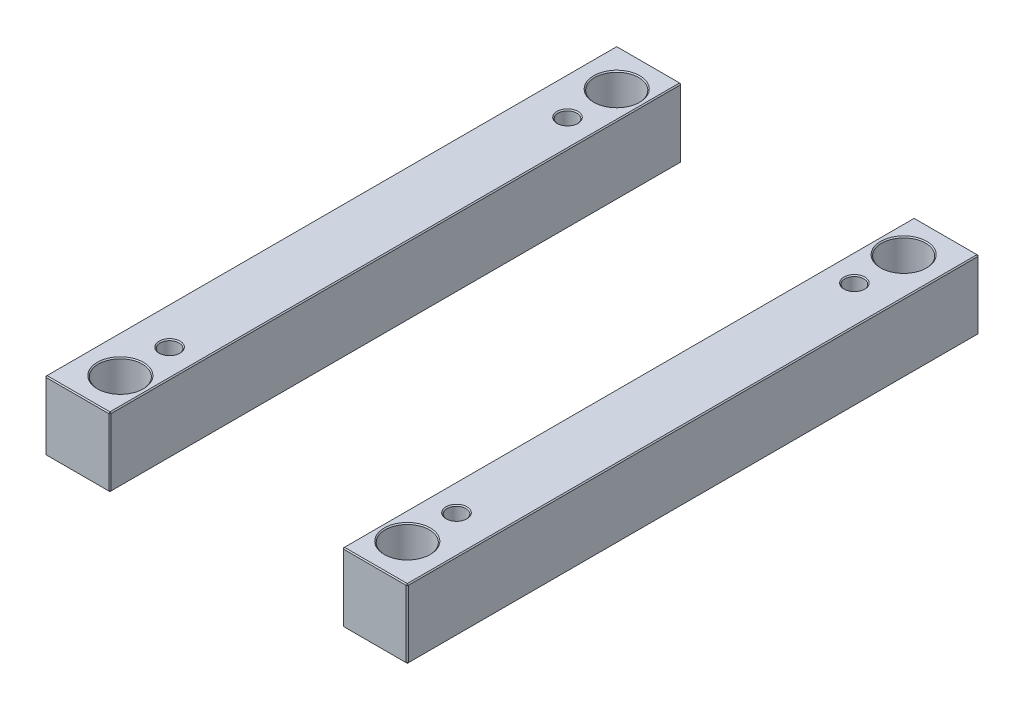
ISO-10303-21;
HEADER;
FILE_DESCRIPTION(('STEP AP214'),'2;1');
FILE_NAME('part.step','',(''),(''),'','','');
FILE_SCHEMA(('AUTOMOTIVE_DESIGN { 1 0 10303 214 1 1 1 1 }'));
ENDSEC;
DATA;
#1=APPLICATION_CONTEXT('core data for automotive mechanical design processes');
#2=APPLICATION_PROTOCOL_DEFINITION('international standard','automotive_design',2000,#1);
#3=PRODUCT_CONTEXT('',#1,'mechanical');
#4=PRODUCT('Part','Part','',(#3));
#5=PRODUCT_RELATED_PRODUCT_CATEGORY('part','',(#4));
#6=PRODUCT_DEFINITION_FORMATION('','',#4);
#7=PRODUCT_DEFINITION_CONTEXT('part definition',#1,'design');
#8=PRODUCT_DEFINITION('design','',#6,#7);
#9=PRODUCT_DEFINITION_SHAPE('','',#8);
#10=(LENGTH_UNIT() NAMED_UNIT(*) SI_UNIT(.MILLI.,.METRE.));
#11=(NAMED_UNIT(*) PLANE_ANGLE_UNIT() SI_UNIT($,.RADIAN.));
#12=(NAMED_UNIT(*) SI_UNIT($,.STERADIAN.) SOLID_ANGLE_UNIT());
#13=UNCERTAINTY_MEASURE_WITH_UNIT(LENGTH_MEASURE(1.E-05),#10,'distance_accuracy_value','');
#14=(GEOMETRIC_REPRESENTATION_CONTEXT(3) GLOBAL_UNCERTAINTY_ASSIGNED_CONTEXT((#13)) GLOBAL_UNIT_ASSIGNED_CONTEXT((#10,
#11,#12)) REPRESENTATION_CONTEXT('',''));
#15=CARTESIAN_POINT('',(0.,0.,0.));
#16=DIRECTION('',(0.,0.,1.));
#17=DIRECTION('',(1.,0.,0.));
#18=AXIS2_PLACEMENT_3D('',#15,#16,#17);
#19=CARTESIAN_POINT('',(-173.,66.,-273.));
#20=DIRECTION('',(0.,0.,1.));
#21=DIRECTION('',(1.,0.,0.));
#22=AXIS2_PLACEMENT_3D('',#19,#20,#21);
#23=PLANE('',#22);
#24=DIRECTION('',(-1.,0.,0.));
#25=VECTOR('',#24,1.);
#26=CARTESIAN_POINT('',(-173.,1.00000000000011,-273.));
#27=LINE('',#26,#25);
#28=CARTESIAN_POINT('',(-112.,1.00000000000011,-273.));
#29=VERTEX_POINT('',#28);
#30=CARTESIAN_POINT('',(-172.,1.00000000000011,-273.));
#31=VERTEX_POINT('',#30);
#32=EDGE_CURVE('P0_E137',#29,#31,#27,.T.);
#33=ORIENTED_EDGE('',*,*,#32,.T.);
#34=DIRECTION('',(0.,1.,0.));
#35=VECTOR('',#34,1.);
#36=CARTESIAN_POINT('',(-172.,66.,-273.));
#37=LINE('',#36,#35);
#38=CARTESIAN_POINT('',(-172.,65.,-273.));
#39=VERTEX_POINT('',#38);
#40=EDGE_CURVE('P0_E265',#31,#39,#37,.T.);
#41=ORIENTED_EDGE('',*,*,#40,.T.);
#42=DIRECTION('',(1.,0.,0.));
#43=VECTOR('',#42,1.);
#44=CARTESIAN_POINT('',(-173.,65.,-273.));
#45=LINE('',#44,#43);
#46=CARTESIAN_POINT('',(-112.,65.,-273.));
#47=VERTEX_POINT('',#46);
#48=EDGE_CURVE('P0_E263',#39,#47,#45,.T.);
#49=ORIENTED_EDGE('',*,*,#48,.T.);
#50=DIRECTION('',(0.,-1.,0.));
#51=VECTOR('',#50,1.);
#52=CARTESIAN_POINT('',(-112.,66.,-273.));
#53=LINE('',#52,#51);
#54=EDGE_CURVE('P0_E260',#47,#29,#53,.T.);
#55=ORIENTED_EDGE('',*,*,#54,.T.);
#56=EDGE_LOOP('',(#33,#41,#49,#55));
#57=FACE_BOUND('',#56,.T.);
#58=ADVANCED_FACE('P0_F16',(#57),#23,.F.);
#59=CARTESIAN_POINT('',(-173.,66.,273.));
#60=DIRECTION('',(1.,0.,0.));
#61=DIRECTION('',(0.,0.,-1.));
#62=AXIS2_PLACEMENT_3D('',#59,#60,#61);
#63=PLANE('',#62);
#64=DIRECTION('',(0.,1.,0.));
#65=VECTOR('',#64,1.);
#66=CARTESIAN_POINT('',(-173.,66.,272.));
#67=LINE('',#66,#65);
#68=CARTESIAN_POINT('',(-173.,1.00000000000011,272.));
#69=VERTEX_POINT('',#68);
#70=CARTESIAN_POINT('',(-173.,65.,272.));
#71=VERTEX_POINT('',#70);
#72=EDGE_CURVE('P0_E253',#69,#71,#67,.T.);
#73=ORIENTED_EDGE('',*,*,#72,.T.);
#74=DIRECTION('',(0.,0.,-1.));
#75=VECTOR('',#74,1.);
#76=CARTESIAN_POINT('',(-173.,65.,273.));
#77=LINE('',#76,#75);
#78=CARTESIAN_POINT('',(-173.,65.,-272.));
#79=VERTEX_POINT('',#78);
#80=EDGE_CURVE('P0_E258',#71,#79,#77,.T.);
#81=ORIENTED_EDGE('',*,*,#80,.T.);
#82=DIRECTION('',(0.,-1.,0.));
#83=VECTOR('',#82,1.);
#84=CARTESIAN_POINT('',(-173.,66.,-272.));
#85=LINE('',#84,#83);
#86=CARTESIAN_POINT('',(-173.,1.00000000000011,-272.));
#87=VERTEX_POINT('',#86);
#88=EDGE_CURVE('P0_E255',#79,#87,#85,.T.);
#89=ORIENTED_EDGE('',*,*,#88,.T.);
#90=DIRECTION('',(0.,0.,1.));
#91=VECTOR('',#90,1.);
#92=CARTESIAN_POINT('',(-173.,1.00000000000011,273.));
#93=LINE('',#92,#91);
#94=EDGE_CURVE('P0_E251',#87,#69,#93,.T.);
#95=ORIENTED_EDGE('',*,*,#94,.T.);
#96=EDGE_LOOP('',(#73,#81,#89,#95));
#97=FACE_BOUND('',#96,.T.);
#98=ADVANCED_FACE('P0_F333',(#97),#63,.F.);
#99=CARTESIAN_POINT('',(-173.,66.,273.));
#100=DIRECTION('',(0.,0.,-1.));
#101=DIRECTION('',(-1.,0.,0.));
#102=AXIS2_PLACEMENT_3D('',#99,#100,#101);
#103=PLANE('',#102);
#104=DIRECTION('',(-1.,0.,0.));
#105=VECTOR('',#104,1.);
#106=CARTESIAN_POINT('',(-173.,65.,273.));
#107=LINE('',#106,#105);
#108=CARTESIAN_POINT('',(-112.,65.,273.));
#109=VERTEX_POINT('',#108);
#110=CARTESIAN_POINT('',(-172.,65.,273.));
#111=VERTEX_POINT('',#110);
#112=EDGE_CURVE('P0_E272',#109,#111,#107,.T.);
#113=ORIENTED_EDGE('',*,*,#112,.T.);
#114=DIRECTION('',(0.,-1.,0.));
#115=VECTOR('',#114,1.);
#116=CARTESIAN_POINT('',(-172.,66.,273.));
#117=LINE('',#116,#115);
#118=CARTESIAN_POINT('',(-172.,1.00000000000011,273.));
#119=VERTEX_POINT('',#118);
#120=EDGE_CURVE('P0_E274',#111,#119,#117,.T.);
#121=ORIENTED_EDGE('',*,*,#120,.T.);
#122=DIRECTION('',(1.,0.,0.));
#123=VECTOR('',#122,1.);
#124=CARTESIAN_POINT('',(-111.,1.00000000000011,273.));
#125=LINE('',#124,#123);
#126=CARTESIAN_POINT('',(-112.,1.00000000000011,273.));
#127=VERTEX_POINT('',#126);
#128=EDGE_CURVE('P0_E270',#119,#127,#125,.T.);
#129=ORIENTED_EDGE('',*,*,#128,.T.);
#130=DIRECTION('',(0.,1.,0.));
#131=VECTOR('',#130,1.);
#132=CARTESIAN_POINT('',(-112.,66.,273.));
#133=LINE('',#132,#131);
#134=EDGE_CURVE('P0_E268',#127,#109,#133,.T.);
#135=ORIENTED_EDGE('',*,*,#134,.T.);
#136=EDGE_LOOP('',(#113,#121,#129,#135));
#137=FACE_BOUND('',#136,.T.);
#138=ADVANCED_FACE('P0_F372',(#137),#103,.F.);
#139=CARTESIAN_POINT('',(-111.,66.,-273.));
#140=DIRECTION('',(-1.,0.,0.));
#141=DIRECTION('',(0.,0.,1.));
#142=AXIS2_PLACEMENT_3D('',#139,#140,#141);
#143=PLANE('',#142);
#144=DIRECTION('',(0.,0.,1.));
#145=VECTOR('',#144,1.);
#146=CARTESIAN_POINT('',(-111.,65.,-273.));
#147=LINE('',#146,#145);
#148=CARTESIAN_POINT('',(-111.,65.,-272.));
#149=VERTEX_POINT('',#148);
#150=CARTESIAN_POINT('',(-111.,65.,272.));
#151=VERTEX_POINT('',#150);
#152=EDGE_CURVE('P0_E31',#149,#151,#147,.T.);
#153=ORIENTED_EDGE('',*,*,#152,.T.);
#154=DIRECTION('',(0.,-1.,0.));
#155=VECTOR('',#154,1.);
#156=CARTESIAN_POINT('',(-111.,66.,272.));
#157=LINE('',#156,#155);
#158=CARTESIAN_POINT('',(-111.,1.00000000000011,272.));
#159=VERTEX_POINT('',#158);
#160=EDGE_CURVE('P0_E190',#151,#159,#157,.T.);
#161=ORIENTED_EDGE('',*,*,#160,.T.);
#162=DIRECTION('',(0.,0.,-1.));
#163=VECTOR('',#162,1.);
#164=CARTESIAN_POINT('',(-111.,1.00000000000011,-273.));
#165=LINE('',#164,#163);
#166=CARTESIAN_POINT('',(-111.,1.00000000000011,-272.));
#167=VERTEX_POINT('',#166);
#168=EDGE_CURVE('P0_E286',#159,#167,#165,.T.);
#169=ORIENTED_EDGE('',*,*,#168,.T.);
#170=DIRECTION('',(0.,1.,0.));
#171=VECTOR('',#170,1.);
#172=CARTESIAN_POINT('',(-111.,66.,-272.));
#173=LINE('',#172,#171);
#174=EDGE_CURVE('P0_E36',#167,#149,#173,.T.);
#175=ORIENTED_EDGE('',*,*,#174,.T.);
#176=EDGE_LOOP('',(#153,#161,#169,#175));
#177=FACE_BOUND('',#176,.T.);
#178=ADVANCED_FACE('P0_F649',(#177),#143,.F.);
#179=CARTESIAN_POINT('',(0.,66.,0.));
#180=DIRECTION('',(0.,-1.,0.));
#181=DIRECTION('',(0.,0.,-1.));
#182=AXIS2_PLACEMENT_3D('',#179,#180,#181);
#183=PLANE('',#182);
#184=CARTESIAN_POINT('',(-137.,66.,-237.));
#185=DIRECTION('',(0.,-1.,0.));
#186=DIRECTION('',(0.,0.,-1.));
#187=AXIS2_PLACEMENT_3D('',#184,#185,#186);
#188=CIRCLE('',#187,22.);
#189=CARTESIAN_POINT('',(-137.,66.,-259.));
#190=VERTEX_POINT('',#189);
#191=EDGE_CURVE('P0_E214',#190,#190,#188,.T.);
#192=ORIENTED_EDGE('',*,*,#191,.T.);
#193=EDGE_LOOP('',(#192));
#194=FACE_BOUND('',#193,.T.);
#195=CARTESIAN_POINT('',(-137.,66.,237.));
#196=DIRECTION('',(0.,-1.,0.));
#197=DIRECTION('',(0.,0.,-1.));
#198=AXIS2_PLACEMENT_3D('',#195,#196,#197);
#199=CIRCLE('',#198,22.);
#200=CARTESIAN_POINT('',(-137.,66.,215.));
#201=VERTEX_POINT('',#200);
#202=EDGE_CURVE('P0_E211',#201,#201,#199,.T.);
#203=ORIENTED_EDGE('',*,*,#202,.T.);
#204=EDGE_LOOP('',(#203));
#205=FACE_BOUND('',#204,.T.);
#206=CARTESIAN_POINT('',(-137.,66.,190.));
#207=DIRECTION('',(0.,-1.,0.));
#208=DIRECTION('',(0.,0.,-1.));
#209=AXIS2_PLACEMENT_3D('',#206,#207,#208);
#210=CIRCLE('',#209,10.0000000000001);
#211=CARTESIAN_POINT('',(-137.,66.,180.));
#212=VERTEX_POINT('',#211);
#213=EDGE_CURVE('P0_E193',#212,#212,#210,.T.);
#214=ORIENTED_EDGE('',*,*,#213,.T.);
#215=EDGE_LOOP('',(#214));
#216=FACE_BOUND('',#215,.T.);
#217=CARTESIAN_POINT('',(-137.,66.,-190.));
#218=DIRECTION('',(0.,-1.,0.));
#219=DIRECTION('',(0.,0.,-1.));
#220=AXIS2_PLACEMENT_3D('',#217,#218,#219);
#221=CIRCLE('',#220,10.0000000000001);
#222=CARTESIAN_POINT('',(-137.,66.,-200.));
#223=VERTEX_POINT('',#222);
#224=EDGE_CURVE('P0_E189',#223,#223,#221,.T.);
#225=ORIENTED_EDGE('',*,*,#224,.T.);
#226=EDGE_LOOP('',(#225));
#227=FACE_BOUND('',#226,.T.);
#228=DIRECTION('',(0.,0.,1.));
#229=VECTOR('',#228,1.);
#230=CARTESIAN_POINT('',(-172.,66.,0.));
#231=LINE('',#230,#229);
#232=CARTESIAN_POINT('',(-172.,66.,-272.));
#233=VERTEX_POINT('',#232);
#234=CARTESIAN_POINT('',(-172.,66.,272.));
#235=VERTEX_POINT('',#234);
#236=EDGE_CURVE('P0_E281',#233,#235,#231,.T.);
#237=ORIENTED_EDGE('',*,*,#236,.T.);
#238=DIRECTION('',(1.,0.,0.));
#239=VECTOR('',#238,1.);
#240=CARTESIAN_POINT('',(0.,66.,272.));
#241=LINE('',#240,#239);
#242=CARTESIAN_POINT('',(-112.,66.,272.));
#243=VERTEX_POINT('',#242);
#244=EDGE_CURVE('P0_E283',#235,#243,#241,.T.);
#245=ORIENTED_EDGE('',*,*,#244,.T.);
#246=DIRECTION('',(0.,0.,-1.));
#247=VECTOR('',#246,1.);
#248=CARTESIAN_POINT('',(-112.,66.,0.));
#249=LINE('',#248,#247);
#250=CARTESIAN_POINT('',(-112.,66.,-272.));
#251=VERTEX_POINT('',#250);
#252=EDGE_CURVE('P0_E277',#243,#251,#249,.T.);
#253=ORIENTED_EDGE('',*,*,#252,.T.);
#254=DIRECTION('',(-1.,0.,0.));
#255=VECTOR('',#254,1.);
#256=CARTESIAN_POINT('',(-2.43532792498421E-13,66.,-272.));
#257=LINE('',#256,#255);
#258=EDGE_CURVE('P0_E279',#251,#233,#257,.T.);
#259=ORIENTED_EDGE('',*,*,#258,.T.);
#260=EDGE_LOOP('',(#237,#245,#253,#259));
#261=FACE_BOUND('',#260,.T.);
#262=ADVANCED_FACE('P0_F229',(#194,#205,#216,#227,#261),#183,.F.);
#263=CARTESIAN_POINT('',(0.,0.,0.));
#264=DIRECTION('',(0.,-1.,0.));
#265=DIRECTION('',(0.,0.,-1.));
#266=AXIS2_PLACEMENT_3D('',#263,#264,#265);
#267=PLANE('',#266);
#268=CARTESIAN_POINT('',(-137.,0.,-237.));
#269=DIRECTION('',(0.,-1.,0.));
#270=DIRECTION('',(0.,0.,-1.));
#271=AXIS2_PLACEMENT_3D('',#268,#269,#270);
#272=CIRCLE('',#271,22.);
#273=CARTESIAN_POINT('',(-137.,0.,-259.));
#274=VERTEX_POINT('',#273);
#275=EDGE_CURVE('P0_E202',#274,#274,#272,.F.);
#276=ORIENTED_EDGE('',*,*,#275,.T.);
#277=EDGE_LOOP('',(#276));
#278=FACE_BOUND('',#277,.T.);
#279=CARTESIAN_POINT('',(-137.,0.,237.));
#280=DIRECTION('',(0.,-1.,0.));
#281=DIRECTION('',(0.,0.,-1.));
#282=AXIS2_PLACEMENT_3D('',#279,#280,#281);
#283=CIRCLE('',#282,22.);
#284=CARTESIAN_POINT('',(-137.,0.,215.));
#285=VERTEX_POINT('',#284);
#286=EDGE_CURVE('P0_E199',#285,#285,#283,.F.);
#287=ORIENTED_EDGE('',*,*,#286,.T.);
#288=EDGE_LOOP('',(#287));
#289=FACE_BOUND('',#288,.T.);
#290=CARTESIAN_POINT('',(-137.,0.,-190.));
#291=DIRECTION('',(0.,-1.,0.));
#292=DIRECTION('',(0.,0.,-1.));
#293=AXIS2_PLACEMENT_3D('',#290,#291,#292);
#294=CIRCLE('',#293,9.99999999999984);
#295=CARTESIAN_POINT('',(-137.,0.,-200.));
#296=VERTEX_POINT('',#295);
#297=EDGE_CURVE('P0_E235',#296,#296,#294,.F.);
#298=ORIENTED_EDGE('',*,*,#297,.T.);
#299=EDGE_LOOP('',(#298));
#300=FACE_BOUND('',#299,.T.);
#301=CARTESIAN_POINT('',(-137.,0.,190.));
#302=DIRECTION('',(0.,-1.,0.));
#303=DIRECTION('',(0.,0.,-1.));
#304=AXIS2_PLACEMENT_3D('',#301,#302,#303);
#305=CIRCLE('',#304,10.);
#306=CARTESIAN_POINT('',(-137.,0.,180.));
#307=VERTEX_POINT('',#306);
#308=EDGE_CURVE('P0_E238',#307,#307,#305,.F.);
#309=ORIENTED_EDGE('',*,*,#308,.T.);
#310=EDGE_LOOP('',(#309));
#311=FACE_BOUND('',#310,.T.);
#312=DIRECTION('',(-1.,0.,0.));
#313=VECTOR('',#312,1.);
#314=CARTESIAN_POINT('',(-173.,0.,272.));
#315=LINE('',#314,#313);
#316=CARTESIAN_POINT('',(-112.,0.,272.));
#317=VERTEX_POINT('',#316);
#318=CARTESIAN_POINT('',(-172.,0.,272.));
#319=VERTEX_POINT('',#318);
#320=EDGE_CURVE('P0_E114',#317,#319,#315,.T.);
#321=ORIENTED_EDGE('',*,*,#320,.T.);
#322=DIRECTION('',(0.,0.,-1.));
#323=VECTOR('',#322,1.);
#324=CARTESIAN_POINT('',(-172.,0.,-273.));
#325=LINE('',#324,#323);
#326=CARTESIAN_POINT('',(-172.,0.,-272.));
#327=VERTEX_POINT('',#326);
#328=EDGE_CURVE('P0_E110',#319,#327,#325,.T.);
#329=ORIENTED_EDGE('',*,*,#328,.T.);
#330=DIRECTION('',(1.,0.,0.));
#331=VECTOR('',#330,1.);
#332=CARTESIAN_POINT('',(-111.,0.,-272.));
#333=LINE('',#332,#331);
#334=CARTESIAN_POINT('',(-112.,0.,-272.));
#335=VERTEX_POINT('',#334);
#336=EDGE_CURVE('P0_E104',#327,#335,#333,.T.);
#337=ORIENTED_EDGE('',*,*,#336,.T.);
#338=DIRECTION('',(0.,0.,1.));
#339=VECTOR('',#338,1.);
#340=CARTESIAN_POINT('',(-112.,0.,273.));
#341=LINE('',#340,#339);
#342=EDGE_CURVE('P0_E107',#335,#317,#341,.T.);
#343=ORIENTED_EDGE('',*,*,#342,.T.);
#344=EDGE_LOOP('',(#321,#329,#337,#343));
#345=FACE_BOUND('',#344,.T.);
#346=ADVANCED_FACE('P0_F106',(#278,#289,#300,#311,#345),#267,.T.);
#347=CARTESIAN_POINT('',(-137.,0.,-190.));
#348=DIRECTION('',(0.,1.,0.));
#349=DIRECTION('',(0.,0.,1.));
#350=AXIS2_PLACEMENT_3D('',#347,#348,#349);
#351=CYLINDRICAL_SURFACE('',#350,9.);
#352=CARTESIAN_POINT('',(-137.,65.,-190.));
#353=DIRECTION('',(0.,-1.,0.));
#354=DIRECTION('',(0.,0.,-1.));
#355=AXIS2_PLACEMENT_3D('',#352,#353,#354);
#356=CIRCLE('',#355,9.);
#357=CARTESIAN_POINT('',(-137.,65.,-199.));
#358=VERTEX_POINT('',#357);
#359=EDGE_CURVE('P0_E196',#358,#358,#356,.F.);
#360=ORIENTED_EDGE('',*,*,#359,.T.);
#361=EDGE_LOOP('',(#360));
#362=FACE_BOUND('',#361,.T.);
#363=CARTESIAN_POINT('',(-137.,0.999999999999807,-190.));
#364=DIRECTION('',(0.,-1.,0.));
#365=DIRECTION('',(0.,0.,-1.));
#366=AXIS2_PLACEMENT_3D('',#363,#364,#365);
#367=CIRCLE('',#366,9.);
#368=CARTESIAN_POINT('',(-137.,0.999999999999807,-199.));
#369=VERTEX_POINT('',#368);
#370=EDGE_CURVE('P0_E241',#369,#369,#367,.T.);
#371=ORIENTED_EDGE('',*,*,#370,.T.);
#372=EDGE_LOOP('',(#371));
#373=FACE_BOUND('',#372,.T.);
#374=ADVANCED_FACE('P0_F228',(#362,#373),#351,.F.);
#375=CARTESIAN_POINT('',(-137.,0.,190.));
#376=DIRECTION('',(0.,1.,0.));
#377=DIRECTION('',(0.,0.,1.));
#378=AXIS2_PLACEMENT_3D('',#375,#376,#377);
#379=CYLINDRICAL_SURFACE('',#378,9.);
#380=CARTESIAN_POINT('',(-137.,65.,190.));
#381=DIRECTION('',(0.,-1.,0.));
#382=DIRECTION('',(0.,0.,-1.));
#383=AXIS2_PLACEMENT_3D('',#380,#381,#382);
#384=CIRCLE('',#383,9.);
#385=CARTESIAN_POINT('',(-137.,65.,181.));
#386=VERTEX_POINT('',#385);
#387=EDGE_CURVE('P0_E186',#386,#386,#384,.F.);
#388=ORIENTED_EDGE('',*,*,#387,.T.);
#389=EDGE_LOOP('',(#388));
#390=FACE_BOUND('',#389,.T.);
#391=CARTESIAN_POINT('',(-137.,0.999999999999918,190.));
#392=DIRECTION('',(0.,-1.,0.));
#393=DIRECTION('',(0.,0.,-1.));
#394=AXIS2_PLACEMENT_3D('',#391,#392,#393);
#395=CIRCLE('',#394,9.);
#396=CARTESIAN_POINT('',(-137.,0.999999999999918,181.));
#397=VERTEX_POINT('',#396);
#398=EDGE_CURVE('P0_E248',#397,#397,#395,.T.);
#399=ORIENTED_EDGE('',*,*,#398,.T.);
#400=EDGE_LOOP('',(#399));
#401=FACE_BOUND('',#400,.T.);
#402=ADVANCED_FACE('P0_F380',(#390,#401),#379,.F.);
#403=CARTESIAN_POINT('',(-137.,0.,-190.));
#404=DIRECTION('',(0.,-1.,0.));
#405=DIRECTION('',(0.,0.,-1.));
#406=AXIS2_PLACEMENT_3D('',#403,#404,#405);
#407=CONICAL_SURFACE('',#406,9.99999999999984,0.78539816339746);
#408=ORIENTED_EDGE('',*,*,#370,.F.);
#409=EDGE_LOOP('',(#408));
#410=FACE_BOUND('',#409,.T.);
#411=ORIENTED_EDGE('',*,*,#297,.F.);
#412=EDGE_LOOP('',(#411));
#413=FACE_BOUND('',#412,.T.);
#414=ADVANCED_FACE('P0_F376',(#410,#413),#407,.F.);
#415=CARTESIAN_POINT('',(-137.,0.,190.));
#416=DIRECTION('',(0.,-1.,0.));
#417=DIRECTION('',(0.,0.,-1.));
#418=AXIS2_PLACEMENT_3D('',#415,#416,#417);
#419=CONICAL_SURFACE('',#418,10.,0.785398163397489);
#420=ORIENTED_EDGE('',*,*,#398,.F.);
#421=EDGE_LOOP('',(#420));
#422=FACE_BOUND('',#421,.T.);
#423=ORIENTED_EDGE('',*,*,#308,.F.);
#424=EDGE_LOOP('',(#423));
#425=FACE_BOUND('',#424,.T.);
#426=ADVANCED_FACE('P0_F379',(#422,#425),#419,.F.);
#427=CARTESIAN_POINT('',(-111.,66.,272.));
#428=DIRECTION('',(-0.707106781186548,0.,-0.707106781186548));
#429=DIRECTION('',(0.,-1.,0.));
#430=AXIS2_PLACEMENT_3D('',#427,#428,#429);
#431=PLANE('',#430);
#432=DIRECTION('',(-0.707106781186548,0.,0.707106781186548));
#433=VECTOR('',#432,1.);
#434=CARTESIAN_POINT('',(-111.5,65.,272.5));
#435=LINE('',#434,#433);
#436=EDGE_CURVE('P0_E125',#109,#151,#435,.F.);
#437=ORIENTED_EDGE('',*,*,#436,.F.);
#438=ORIENTED_EDGE('',*,*,#134,.F.);
#439=DIRECTION('',(0.707106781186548,0.,-0.707106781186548));
#440=VECTOR('',#439,1.);
#441=CARTESIAN_POINT('',(-112.,1.00000000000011,273.));
#442=LINE('',#441,#440);
#443=EDGE_CURVE('P0_E181',#159,#127,#442,.F.);
#444=ORIENTED_EDGE('',*,*,#443,.F.);
#445=ORIENTED_EDGE('',*,*,#160,.F.);
#446=EDGE_LOOP('',(#437,#438,#444,#445));
#447=FACE_BOUND('',#446,.T.);
#448=ADVANCED_FACE('P0_F384',(#447),#431,.F.);
#449=CARTESIAN_POINT('',(-112.,66.,272.));
#450=DIRECTION('',(0.577350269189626,0.577350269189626,0.577350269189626));
#451=DIRECTION('',(0.707106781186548,0.,-0.707106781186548));
#452=AXIS2_PLACEMENT_3D('',#449,#450,#451);
#453=PLANE('',#452);
#454=DIRECTION('',(0.,0.707106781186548,-0.707106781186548));
#455=VECTOR('',#454,1.);
#456=CARTESIAN_POINT('',(-112.,66.,272.));
#457=LINE('',#456,#455);
#458=EDGE_CURVE('P0_E175',#109,#243,#457,.T.);
#459=ORIENTED_EDGE('',*,*,#458,.F.);
#460=ORIENTED_EDGE('',*,*,#436,.T.);
#461=DIRECTION('',(0.70710678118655,-0.707106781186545,0.));
#462=VECTOR('',#461,1.);
#463=CARTESIAN_POINT('',(-112.,66.,272.));
#464=LINE('',#463,#462);
#465=EDGE_CURVE('P0_E178',#243,#151,#464,.T.);
#466=ORIENTED_EDGE('',*,*,#465,.F.);
#467=EDGE_LOOP('',(#459,#460,#466));
#468=FACE_BOUND('',#467,.T.);
#469=ADVANCED_FACE('P0_F588',(#468),#453,.T.);
#470=CARTESIAN_POINT('',(-112.,1.00000000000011,273.));
#471=DIRECTION('',(0.577350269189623,-0.577350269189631,0.577350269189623));
#472=DIRECTION('',(0.,-0.707106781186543,-0.707106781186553));
#473=AXIS2_PLACEMENT_3D('',#470,#471,#472);
#474=PLANE('',#473);
#475=DIRECTION('',(0.70710678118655,0.707106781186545,0.));
#476=VECTOR('',#475,1.);
#477=CARTESIAN_POINT('',(-111.5,0.50000000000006,272.));
#478=LINE('',#477,#476);
#479=EDGE_CURVE('P0_E123',#159,#317,#478,.F.);
#480=ORIENTED_EDGE('',*,*,#479,.F.);
#481=ORIENTED_EDGE('',*,*,#443,.T.);
#482=DIRECTION('',(0.,-0.707106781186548,-0.707106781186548));
#483=VECTOR('',#482,1.);
#484=CARTESIAN_POINT('',(-112.,1.00000000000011,273.));
#485=LINE('',#484,#483);
#486=EDGE_CURVE('P0_E172',#317,#127,#485,.F.);
#487=ORIENTED_EDGE('',*,*,#486,.F.);
#488=EDGE_LOOP('',(#480,#481,#487));
#489=FACE_BOUND('',#488,.T.);
#490=ADVANCED_FACE('P0_F597',(#489),#474,.T.);
#491=CARTESIAN_POINT('',(-112.,66.,0.));
#492=DIRECTION('',(-0.707106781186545,-0.70710678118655,0.));
#493=DIRECTION('',(0.,0.,-1.));
#494=AXIS2_PLACEMENT_3D('',#491,#492,#493);
#495=PLANE('',#494);
#496=ORIENTED_EDGE('',*,*,#465,.T.);
#497=ORIENTED_EDGE('',*,*,#152,.F.);
#498=DIRECTION('',(-0.70710678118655,0.707106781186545,0.));
#499=VECTOR('',#498,1.);
#500=CARTESIAN_POINT('',(-111.5,65.5,-272.));
#501=LINE('',#500,#499);
#502=EDGE_CURVE('P0_E165',#251,#149,#501,.F.);
#503=ORIENTED_EDGE('',*,*,#502,.F.);
#504=ORIENTED_EDGE('',*,*,#252,.F.);
#505=EDGE_LOOP('',(#496,#497,#503,#504));
#506=FACE_BOUND('',#505,.T.);
#507=ADVANCED_FACE('P0_F349',(#506),#495,.F.);
#508=CARTESIAN_POINT('',(0.,66.,272.));
#509=DIRECTION('',(0.,-0.707106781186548,-0.707106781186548));
#510=DIRECTION('',(1.,0.,0.));
#511=AXIS2_PLACEMENT_3D('',#508,#509,#510);
#512=PLANE('',#511);
#513=ORIENTED_EDGE('',*,*,#458,.T.);
#514=ORIENTED_EDGE('',*,*,#244,.F.);
#515=DIRECTION('',(0.,-0.707106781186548,0.707106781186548));
#516=VECTOR('',#515,1.);
#517=CARTESIAN_POINT('',(-172.,65.5,272.5));
#518=LINE('',#517,#516);
#519=EDGE_CURVE('P0_E162',#111,#235,#518,.F.);
#520=ORIENTED_EDGE('',*,*,#519,.F.);
#521=ORIENTED_EDGE('',*,*,#112,.F.);
#522=EDGE_LOOP('',(#513,#514,#520,#521));
#523=FACE_BOUND('',#522,.T.);
#524=ADVANCED_FACE('P0_F344',(#523),#512,.F.);
#525=CARTESIAN_POINT('',(-172.,66.,273.));
#526=DIRECTION('',(0.707106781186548,0.,-0.707106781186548));
#527=DIRECTION('',(0.,-1.,0.));
#528=AXIS2_PLACEMENT_3D('',#525,#526,#527);
#529=PLANE('',#528);
#530=DIRECTION('',(0.707106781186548,0.,0.707106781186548));
#531=VECTOR('',#530,1.);
#532=CARTESIAN_POINT('',(-172.,1.00000000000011,273.));
#533=LINE('',#532,#531);
#534=EDGE_CURVE('P0_E156',#119,#69,#533,.F.);
#535=ORIENTED_EDGE('',*,*,#534,.F.);
#536=ORIENTED_EDGE('',*,*,#120,.F.);
#537=DIRECTION('',(-0.707106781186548,0.,-0.707106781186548));
#538=VECTOR('',#537,1.);
#539=CARTESIAN_POINT('',(-173.,65.,272.));
#540=LINE('',#539,#538);
#541=EDGE_CURVE('P0_E159',#71,#111,#540,.F.);
#542=ORIENTED_EDGE('',*,*,#541,.F.);
#543=ORIENTED_EDGE('',*,*,#72,.F.);
#544=EDGE_LOOP('',(#535,#536,#542,#543));
#545=FACE_BOUND('',#544,.T.);
#546=ADVANCED_FACE('P0_F338',(#545),#529,.F.);
#547=CARTESIAN_POINT('',(-173.,1.00000000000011,273.));
#548=DIRECTION('',(0.,-0.707106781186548,0.707106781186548));
#549=DIRECTION('',(-1.,0.,0.));
#550=AXIS2_PLACEMENT_3D('',#547,#548,#549);
#551=PLANE('',#550);
#552=ORIENTED_EDGE('',*,*,#486,.T.);
#553=ORIENTED_EDGE('',*,*,#128,.F.);
#554=DIRECTION('',(0.,0.707106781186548,0.707106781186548));
#555=VECTOR('',#554,1.);
#556=CARTESIAN_POINT('',(-172.,1.00000000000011,273.));
#557=LINE('',#556,#555);
#558=EDGE_CURVE('P0_E134',#319,#119,#557,.T.);
#559=ORIENTED_EDGE('',*,*,#558,.F.);
#560=ORIENTED_EDGE('',*,*,#320,.F.);
#561=EDGE_LOOP('',(#552,#553,#559,#560));
#562=FACE_BOUND('',#561,.T.);
#563=ADVANCED_FACE('P0_F364',(#562),#551,.T.);
#564=CARTESIAN_POINT('',(-111.,1.00000000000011,-273.));
#565=DIRECTION('',(0.707106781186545,-0.70710678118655,0.));
#566=DIRECTION('',(0.,0.,1.));
#567=AXIS2_PLACEMENT_3D('',#564,#565,#566);
#568=PLANE('',#567);
#569=ORIENTED_EDGE('',*,*,#479,.T.);
#570=ORIENTED_EDGE('',*,*,#342,.F.);
#571=DIRECTION('',(-0.70710678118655,-0.707106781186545,0.));
#572=VECTOR('',#571,1.);
#573=CARTESIAN_POINT('',(-112.,0.,-272.));
#574=LINE('',#573,#572);
#575=EDGE_CURVE('P0_E120',#167,#335,#574,.T.);
#576=ORIENTED_EDGE('',*,*,#575,.F.);
#577=ORIENTED_EDGE('',*,*,#168,.F.);
#578=EDGE_LOOP('',(#569,#570,#576,#577));
#579=FACE_BOUND('',#578,.T.);
#580=ADVANCED_FACE('P0_F119',(#579),#568,.T.);
#581=CARTESIAN_POINT('',(-112.,66.,-273.));
#582=DIRECTION('',(-0.707106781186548,0.,0.707106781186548));
#583=DIRECTION('',(0.,-1.,0.));
#584=AXIS2_PLACEMENT_3D('',#581,#582,#583);
#585=PLANE('',#584);
#586=DIRECTION('',(0.707106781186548,0.,0.707106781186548));
#587=VECTOR('',#586,1.);
#588=CARTESIAN_POINT('',(-112.,65.,-273.));
#589=LINE('',#588,#587);
#590=EDGE_CURVE('P0_E168',#149,#47,#589,.F.);
#591=ORIENTED_EDGE('',*,*,#590,.F.);
#592=ORIENTED_EDGE('',*,*,#174,.F.);
#593=DIRECTION('',(-0.707106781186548,0.,-0.707106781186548));
#594=VECTOR('',#593,1.);
#595=CARTESIAN_POINT('',(-111.5,1.00000000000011,-272.5));
#596=LINE('',#595,#594);
#597=EDGE_CURVE('P0_E133',#29,#167,#596,.F.);
#598=ORIENTED_EDGE('',*,*,#597,.F.);
#599=ORIENTED_EDGE('',*,*,#54,.F.);
#600=EDGE_LOOP('',(#591,#592,#598,#599));
#601=FACE_BOUND('',#600,.T.);
#602=ADVANCED_FACE('P0_F354',(#601),#585,.F.);
#603=CARTESIAN_POINT('',(-112.,65.,-273.));
#604=DIRECTION('',(0.577350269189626,0.577350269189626,-0.577350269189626));
#605=DIRECTION('',(-0.707106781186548,0.,-0.707106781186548));
#606=AXIS2_PLACEMENT_3D('',#603,#604,#605);
#607=PLANE('',#606);
#608=ORIENTED_EDGE('',*,*,#502,.T.);
#609=ORIENTED_EDGE('',*,*,#590,.T.);
#610=DIRECTION('',(0.,-0.707106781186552,-0.707106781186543));
#611=VECTOR('',#610,1.);
#612=CARTESIAN_POINT('',(-112.,65.,-273.));
#613=LINE('',#612,#611);
#614=EDGE_CURVE('P0_E151',#251,#47,#613,.T.);
#615=ORIENTED_EDGE('',*,*,#614,.F.);
#616=EDGE_LOOP('',(#608,#609,#615));
#617=FACE_BOUND('',#616,.T.);
#618=ADVANCED_FACE('P0_F352',(#617),#607,.T.);
#619=CARTESIAN_POINT('',(-173.,65.,272.));
#620=DIRECTION('',(-0.577350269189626,0.577350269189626,0.577350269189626));
#621=DIRECTION('',(0.707106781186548,0.,0.707106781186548));
#622=AXIS2_PLACEMENT_3D('',#619,#620,#621);
#623=PLANE('',#622);
#624=ORIENTED_EDGE('',*,*,#541,.T.);
#625=ORIENTED_EDGE('',*,*,#519,.T.);
#626=DIRECTION('',(0.707106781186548,0.707106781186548,0.));
#627=VECTOR('',#626,1.);
#628=CARTESIAN_POINT('',(-173.,65.,272.));
#629=LINE('',#628,#627);
#630=EDGE_CURVE('P0_E142',#71,#235,#629,.T.);
#631=ORIENTED_EDGE('',*,*,#630,.F.);
#632=EDGE_LOOP('',(#624,#625,#631));
#633=FACE_BOUND('',#632,.T.);
#634=ADVANCED_FACE('P0_F341',(#633),#623,.T.);
#635=CARTESIAN_POINT('',(-172.,1.00000000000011,273.));
#636=DIRECTION('',(-0.577350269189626,-0.577350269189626,0.577350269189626));
#637=DIRECTION('',(0.707106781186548,0.,0.707106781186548));
#638=AXIS2_PLACEMENT_3D('',#635,#636,#637);
#639=PLANE('',#638);
#640=ORIENTED_EDGE('',*,*,#558,.T.);
#641=ORIENTED_EDGE('',*,*,#534,.T.);
#642=DIRECTION('',(0.707106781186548,-0.707106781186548,0.));
#643=VECTOR('',#642,1.);
#644=CARTESIAN_POINT('',(-172.5,0.500000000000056,272.));
#645=LINE('',#644,#643);
#646=EDGE_CURVE('P0_E138',#319,#69,#645,.F.);
#647=ORIENTED_EDGE('',*,*,#646,.F.);
#648=EDGE_LOOP('',(#640,#641,#647));
#649=FACE_BOUND('',#648,.T.);
#650=ADVANCED_FACE('P0_F403',(#649),#639,.T.);
#651=CARTESIAN_POINT('',(-112.,0.,-272.));
#652=DIRECTION('',(0.577350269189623,-0.577350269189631,-0.577350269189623));
#653=DIRECTION('',(0.,0.707106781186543,-0.707106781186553));
#654=AXIS2_PLACEMENT_3D('',#651,#652,#653);
#655=PLANE('',#654);
#656=ORIENTED_EDGE('',*,*,#597,.T.);
#657=ORIENTED_EDGE('',*,*,#575,.T.);
#658=DIRECTION('',(0.,0.707106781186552,-0.707106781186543));
#659=VECTOR('',#658,1.);
#660=CARTESIAN_POINT('',(-112.,0.,-272.));
#661=LINE('',#660,#659);
#662=EDGE_CURVE('P0_E130',#29,#335,#661,.F.);
#663=ORIENTED_EDGE('',*,*,#662,.F.);
#664=EDGE_LOOP('',(#656,#657,#663));
#665=FACE_BOUND('',#664,.T.);
#666=ADVANCED_FACE('P0_F129',(#665),#655,.T.);
#667=CARTESIAN_POINT('',(-2.43532792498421E-13,66.,-272.));
#668=DIRECTION('',(0.,-0.707106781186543,0.707106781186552));
#669=DIRECTION('',(-1.,0.,0.));
#670=AXIS2_PLACEMENT_3D('',#667,#668,#669);
#671=PLANE('',#670);
#672=ORIENTED_EDGE('',*,*,#614,.T.);
#673=ORIENTED_EDGE('',*,*,#48,.F.);
#674=DIRECTION('',(0.,0.707106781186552,0.707106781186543));
#675=VECTOR('',#674,1.);
#676=CARTESIAN_POINT('',(-172.,65.,-273.));
#677=LINE('',#676,#675);
#678=EDGE_CURVE('P0_E139',#233,#39,#677,.F.);
#679=ORIENTED_EDGE('',*,*,#678,.F.);
#680=ORIENTED_EDGE('',*,*,#258,.F.);
#681=EDGE_LOOP('',(#672,#673,#679,#680));
#682=FACE_BOUND('',#681,.T.);
#683=ADVANCED_FACE('P0_F316',(#682),#671,.F.);
#684=CARTESIAN_POINT('',(-172.,66.,0.));
#685=DIRECTION('',(0.707106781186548,-0.707106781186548,0.));
#686=DIRECTION('',(0.,0.,1.));
#687=AXIS2_PLACEMENT_3D('',#684,#685,#686);
#688=PLANE('',#687);
#689=ORIENTED_EDGE('',*,*,#630,.T.);
#690=ORIENTED_EDGE('',*,*,#236,.F.);
#691=DIRECTION('',(-0.707106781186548,-0.707106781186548,0.));
#692=VECTOR('',#691,1.);
#693=CARTESIAN_POINT('',(-172.5,65.5,-272.));
#694=LINE('',#693,#692);
#695=EDGE_CURVE('P0_E145',#79,#233,#694,.F.);
#696=ORIENTED_EDGE('',*,*,#695,.F.);
#697=ORIENTED_EDGE('',*,*,#80,.F.);
#698=EDGE_LOOP('',(#689,#690,#696,#697));
#699=FACE_BOUND('',#698,.T.);
#700=ADVANCED_FACE('P0_F310',(#699),#688,.F.);
#701=CARTESIAN_POINT('',(-173.,1.00000000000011,273.));
#702=DIRECTION('',(-0.707106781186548,-0.707106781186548,0.));
#703=DIRECTION('',(0.,0.,-1.));
#704=AXIS2_PLACEMENT_3D('',#701,#702,#703);
#705=PLANE('',#704);
#706=ORIENTED_EDGE('',*,*,#646,.T.);
#707=ORIENTED_EDGE('',*,*,#94,.F.);
#708=DIRECTION('',(-0.707106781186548,0.707106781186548,0.));
#709=VECTOR('',#708,1.);
#710=CARTESIAN_POINT('',(-173.,1.00000000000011,-272.));
#711=LINE('',#710,#709);
#712=EDGE_CURVE('P0_E297',#327,#87,#711,.T.);
#713=ORIENTED_EDGE('',*,*,#712,.F.);
#714=ORIENTED_EDGE('',*,*,#328,.F.);
#715=EDGE_LOOP('',(#706,#707,#713,#714));
#716=FACE_BOUND('',#715,.T.);
#717=ADVANCED_FACE('P0_F329',(#716),#705,.T.);
#718=CARTESIAN_POINT('',(-173.,1.00000000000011,-273.));
#719=DIRECTION('',(0.,-0.707106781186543,-0.707106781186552));
#720=DIRECTION('',(1.,0.,0.));
#721=AXIS2_PLACEMENT_3D('',#718,#719,#720);
#722=PLANE('',#721);
#723=ORIENTED_EDGE('',*,*,#662,.T.);
#724=ORIENTED_EDGE('',*,*,#336,.F.);
#725=DIRECTION('',(0.,-0.707106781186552,0.707106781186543));
#726=VECTOR('',#725,1.);
#727=CARTESIAN_POINT('',(-172.,0.500000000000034,-272.5));
#728=LINE('',#727,#726);
#729=EDGE_CURVE('P0_E295',#31,#327,#728,.T.);
#730=ORIENTED_EDGE('',*,*,#729,.F.);
#731=ORIENTED_EDGE('',*,*,#32,.F.);
#732=EDGE_LOOP('',(#723,#724,#730,#731));
#733=FACE_BOUND('',#732,.T.);
#734=ADVANCED_FACE('P0_F136',(#733),#722,.T.);
#735=CARTESIAN_POINT('',(-172.,65.,-273.));
#736=DIRECTION('',(-0.577350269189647,0.577350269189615,-0.577350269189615));
#737=DIRECTION('',(-0.707106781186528,0.,0.707106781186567));
#738=AXIS2_PLACEMENT_3D('',#735,#736,#737);
#739=PLANE('',#738);
#740=ORIENTED_EDGE('',*,*,#695,.T.);
#741=ORIENTED_EDGE('',*,*,#678,.T.);
#742=DIRECTION('',(0.707106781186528,0.,-0.707106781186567));
#743=VECTOR('',#742,1.);
#744=CARTESIAN_POINT('',(-172.,65.,-273.));
#745=LINE('',#744,#743);
#746=EDGE_CURVE('P0_E293',#79,#39,#745,.T.);
#747=ORIENTED_EDGE('',*,*,#746,.F.);
#748=EDGE_LOOP('',(#740,#741,#747));
#749=FACE_BOUND('',#748,.T.);
#750=ADVANCED_FACE('P0_F303',(#749),#739,.T.);
#751=CARTESIAN_POINT('',(-173.,1.00000000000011,-272.));
#752=DIRECTION('',(-0.577350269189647,-0.577350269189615,-0.577350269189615));
#753=DIRECTION('',(-0.707106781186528,0.,0.707106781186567));
#754=AXIS2_PLACEMENT_3D('',#751,#752,#753);
#755=PLANE('',#754);
#756=ORIENTED_EDGE('',*,*,#729,.T.);
#757=ORIENTED_EDGE('',*,*,#712,.T.);
#758=DIRECTION('',(-0.707106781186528,0.,0.707106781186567));
#759=VECTOR('',#758,1.);
#760=CARTESIAN_POINT('',(-173.,1.00000000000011,-272.));
#761=LINE('',#760,#759);
#762=EDGE_CURVE('P0_E291',#31,#87,#761,.T.);
#763=ORIENTED_EDGE('',*,*,#762,.F.);
#764=EDGE_LOOP('',(#756,#757,#763));
#765=FACE_BOUND('',#764,.T.);
#766=ADVANCED_FACE('P0_F325',(#765),#755,.T.);
#767=CARTESIAN_POINT('',(-173.,66.,-272.));
#768=DIRECTION('',(0.707106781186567,0.,0.707106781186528));
#769=DIRECTION('',(0.,-1.,0.));
#770=AXIS2_PLACEMENT_3D('',#767,#768,#769);
#771=PLANE('',#770);
#772=ORIENTED_EDGE('',*,*,#746,.T.);
#773=ORIENTED_EDGE('',*,*,#40,.F.);
#774=ORIENTED_EDGE('',*,*,#762,.T.);
#775=ORIENTED_EDGE('',*,*,#88,.F.);
#776=EDGE_LOOP('',(#772,#773,#774,#775));
#777=FACE_BOUND('',#776,.T.);
#778=ADVANCED_FACE('P0_F323',(#777),#771,.F.);
#779=CARTESIAN_POINT('',(-137.,65.,190.));
#780=DIRECTION('',(0.,1.,0.));
#781=DIRECTION('',(0.,0.,1.));
#782=AXIS2_PLACEMENT_3D('',#779,#780,#781);
#783=CONICAL_SURFACE('',#782,9.,0.78539816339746);
#784=ORIENTED_EDGE('',*,*,#213,.F.);
#785=EDGE_LOOP('',(#784));
#786=FACE_BOUND('',#785,.T.);
#787=ORIENTED_EDGE('',*,*,#387,.F.);
#788=EDGE_LOOP('',(#787));
#789=FACE_BOUND('',#788,.T.);
#790=ADVANCED_FACE('P0_F388',(#786,#789),#783,.F.);
#791=CARTESIAN_POINT('',(-137.,65.,-190.));
#792=DIRECTION('',(0.,1.,0.));
#793=DIRECTION('',(0.,0.,1.));
#794=AXIS2_PLACEMENT_3D('',#791,#792,#793);
#795=CONICAL_SURFACE('',#794,9.,0.78539816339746);
#796=ORIENTED_EDGE('',*,*,#224,.F.);
#797=EDGE_LOOP('',(#796));
#798=FACE_BOUND('',#797,.T.);
#799=ORIENTED_EDGE('',*,*,#359,.F.);
#800=EDGE_LOOP('',(#799));
#801=FACE_BOUND('',#800,.T.);
#802=ADVANCED_FACE('P0_F470',(#798,#801),#795,.F.);
#803=CARTESIAN_POINT('',(-137.,0.,237.));
#804=DIRECTION('',(0.,1.,0.));
#805=DIRECTION('',(0.,0.,1.));
#806=AXIS2_PLACEMENT_3D('',#803,#804,#805);
#807=CYLINDRICAL_SURFACE('',#806,21.);
#808=CARTESIAN_POINT('',(-137.,65.,237.));
#809=DIRECTION('',(0.,-1.,0.));
#810=DIRECTION('',(0.,0.,-1.));
#811=AXIS2_PLACEMENT_3D('',#808,#809,#810);
#812=CIRCLE('',#811,21.);
#813=CARTESIAN_POINT('',(-137.,65.,216.));
#814=VERTEX_POINT('',#813);
#815=EDGE_CURVE('P0_E10',#814,#814,#812,.F.);
#816=ORIENTED_EDGE('',*,*,#815,.T.);
#817=EDGE_LOOP('',(#816));
#818=FACE_BOUND('',#817,.T.);
#819=CARTESIAN_POINT('',(-137.,0.999999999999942,237.));
#820=DIRECTION('',(0.,-1.,0.));
#821=DIRECTION('',(0.,0.,-1.));
#822=AXIS2_PLACEMENT_3D('',#819,#820,#821);
#823=CIRCLE('',#822,21.);
#824=CARTESIAN_POINT('',(-137.,0.999999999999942,216.));
#825=VERTEX_POINT('',#824);
#826=EDGE_CURVE('P0_E24',#825,#825,#823,.T.);
#827=ORIENTED_EDGE('',*,*,#826,.T.);
#828=EDGE_LOOP('',(#827));
#829=FACE_BOUND('',#828,.T.);
#830=ADVANCED_FACE('P0_F219',(#818,#829),#807,.F.);
#831=CARTESIAN_POINT('',(-137.,0.,-237.));
#832=DIRECTION('',(0.,1.,0.));
#833=DIRECTION('',(0.,0.,1.));
#834=AXIS2_PLACEMENT_3D('',#831,#832,#833);
#835=CYLINDRICAL_SURFACE('',#834,21.);
#836=CARTESIAN_POINT('',(-137.,0.999999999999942,-237.));
#837=DIRECTION('',(0.,-1.,0.));
#838=DIRECTION('',(0.,0.,-1.));
#839=AXIS2_PLACEMENT_3D('',#836,#837,#838);
#840=CIRCLE('',#839,21.);
#841=CARTESIAN_POINT('',(-137.,0.999999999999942,-258.));
#842=VERTEX_POINT('',#841);
#843=EDGE_CURVE('P0_E208',#842,#842,#840,.T.);
#844=ORIENTED_EDGE('',*,*,#843,.T.);
#845=EDGE_LOOP('',(#844));
#846=FACE_BOUND('',#845,.T.);
#847=CARTESIAN_POINT('',(-137.,65.,-237.));
#848=DIRECTION('',(0.,-1.,0.));
#849=DIRECTION('',(0.,0.,-1.));
#850=AXIS2_PLACEMENT_3D('',#847,#848,#849);
#851=CIRCLE('',#850,21.);
#852=CARTESIAN_POINT('',(-137.,65.,-258.));
#853=VERTEX_POINT('',#852);
#854=EDGE_CURVE('P0_E205',#853,#853,#851,.F.);
#855=ORIENTED_EDGE('',*,*,#854,.T.);
#856=EDGE_LOOP('',(#855));
#857=FACE_BOUND('',#856,.T.);
#858=ADVANCED_FACE('P0_F487',(#846,#857),#835,.F.);
#859=CARTESIAN_POINT('',(-137.,0.,-237.));
#860=DIRECTION('',(0.,-1.,0.));
#861=DIRECTION('',(0.,0.,-1.));
#862=AXIS2_PLACEMENT_3D('',#859,#860,#861);
#863=CONICAL_SURFACE('',#862,22.,0.785398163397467);
#864=ORIENTED_EDGE('',*,*,#843,.F.);
#865=EDGE_LOOP('',(#864));
#866=FACE_BOUND('',#865,.T.);
#867=ORIENTED_EDGE('',*,*,#275,.F.);
#868=EDGE_LOOP('',(#867));
#869=FACE_BOUND('',#868,.T.);
#870=ADVANCED_FACE('P0_F496',(#866,#869),#863,.F.);
#871=CARTESIAN_POINT('',(-137.,65.,-237.));
#872=DIRECTION('',(0.,1.,0.));
#873=DIRECTION('',(0.,0.,1.));
#874=AXIS2_PLACEMENT_3D('',#871,#872,#873);
#875=CONICAL_SURFACE('',#874,21.,0.785398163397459);
#876=ORIENTED_EDGE('',*,*,#191,.F.);
#877=EDGE_LOOP('',(#876));
#878=FACE_BOUND('',#877,.T.);
#879=ORIENTED_EDGE('',*,*,#854,.F.);
#880=EDGE_LOOP('',(#879));
#881=FACE_BOUND('',#880,.T.);
#882=ADVANCED_FACE('P0_F505',(#878,#881),#875,.F.);
#883=CARTESIAN_POINT('',(-137.,65.,237.));
#884=DIRECTION('',(0.,1.,0.));
#885=DIRECTION('',(0.,0.,1.));
#886=AXIS2_PLACEMENT_3D('',#883,#884,#885);
#887=CONICAL_SURFACE('',#886,21.,0.785398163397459);
#888=ORIENTED_EDGE('',*,*,#202,.F.);
#889=EDGE_LOOP('',(#888));
#890=FACE_BOUND('',#889,.T.);
#891=ORIENTED_EDGE('',*,*,#815,.F.);
#892=EDGE_LOOP('',(#891));
#893=FACE_BOUND('',#892,.T.);
#894=ADVANCED_FACE('P0_F223',(#890,#893),#887,.F.);
#895=CARTESIAN_POINT('',(-137.,0.,237.));
#896=DIRECTION('',(0.,-1.,0.));
#897=DIRECTION('',(0.,0.,-1.));
#898=AXIS2_PLACEMENT_3D('',#895,#896,#897);
#899=CONICAL_SURFACE('',#898,22.,0.785398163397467);
#900=ORIENTED_EDGE('',*,*,#826,.F.);
#901=EDGE_LOOP('',(#900));
#902=FACE_BOUND('',#901,.T.);
#903=ORIENTED_EDGE('',*,*,#286,.F.);
#904=EDGE_LOOP('',(#903));
#905=FACE_BOUND('',#904,.T.);
#906=ADVANCED_FACE('P0_F18',(#902,#905),#899,.F.);
#907=CLOSED_SHELL('',(#58,#98,#138,#178,#262,#346,#374,#402,#414,#426,#448,#469,#490,#507,#524,
#546,#563,#580,#602,#618,#634,#650,#666,#683,#700,#717,#734,#750,#766,#778,#790,#802,#830,#858,
#870,#882,#894,#906));
#908=MANIFOLD_SOLID_BREP('P0_B1',#907);
#909=CARTESIAN_POINT('',(173.,66.,273.));
#910=DIRECTION('',(0.,0.,-1.));
#911=DIRECTION('',(-1.,0.,0.));
#912=AXIS2_PLACEMENT_3D('',#909,#910,#911);
#913=PLANE('',#912);
#914=DIRECTION('',(0.,-1.,0.));
#915=VECTOR('',#914,1.);
#916=CARTESIAN_POINT('',(112.,66.,273.));
#917=LINE('',#916,#915);
#918=CARTESIAN_POINT('',(112.,65.,273.));
#919=VERTEX_POINT('',#918);
#920=CARTESIAN_POINT('',(112.,1.,273.));
#921=VERTEX_POINT('',#920);
#922=EDGE_CURVE('P1_E174',#919,#921,#917,.T.);
#923=ORIENTED_EDGE('',*,*,#922,.T.);
#924=DIRECTION('',(1.,0.,0.));
#925=VECTOR('',#924,1.);
#926=CARTESIAN_POINT('',(173.,1.,273.));
#927=LINE('',#926,#925);
#928=CARTESIAN_POINT('',(172.,1.,273.));
#929=VERTEX_POINT('',#928);
#930=EDGE_CURVE('P1_E176',#921,#929,#927,.T.);
#931=ORIENTED_EDGE('',*,*,#930,.T.);
#932=DIRECTION('',(0.,1.,0.));
#933=VECTOR('',#932,1.);
#934=CARTESIAN_POINT('',(172.,66.,273.));
#935=LINE('',#934,#933);
#936=CARTESIAN_POINT('',(172.,65.,273.));
#937=VERTEX_POINT('',#936);
#938=EDGE_CURVE('P1_E172',#929,#937,#935,.T.);
#939=ORIENTED_EDGE('',*,*,#938,.T.);
#940=DIRECTION('',(-1.,0.,0.));
#941=VECTOR('',#940,1.);
#942=CARTESIAN_POINT('',(111.,65.,273.));
#943=LINE('',#942,#941);
#944=EDGE_CURVE('P1_E170',#937,#919,#943,.T.);
#945=ORIENTED_EDGE('',*,*,#944,.T.);
#946=EDGE_LOOP('',(#923,#931,#939,#945));
#947=FACE_BOUND('',#946,.T.);
#948=ADVANCED_FACE('P1_F16',(#947),#913,.F.);
#949=CARTESIAN_POINT('',(173.,66.,273.));
#950=DIRECTION('',(-1.,0.,0.));
#951=DIRECTION('',(0.,0.,1.));
#952=AXIS2_PLACEMENT_3D('',#949,#950,#951);
#953=PLANE('',#952);
#954=DIRECTION('',(0.,0.,1.));
#955=VECTOR('',#954,1.);
#956=CARTESIAN_POINT('',(173.,65.,273.));
#957=LINE('',#956,#955);
#958=CARTESIAN_POINT('',(173.,65.,-272.));
#959=VERTEX_POINT('',#958);
#960=CARTESIAN_POINT('',(173.,65.,272.));
#961=VERTEX_POINT('',#960);
#962=EDGE_CURVE('P1_E188',#959,#961,#957,.T.);
#963=ORIENTED_EDGE('',*,*,#962,.T.);
#964=DIRECTION('',(0.,-1.,0.));
#965=VECTOR('',#964,1.);
#966=CARTESIAN_POINT('',(173.,66.,272.));
#967=LINE('',#966,#965);
#968=CARTESIAN_POINT('',(173.,1.00000000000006,272.));
#969=VERTEX_POINT('',#968);
#970=EDGE_CURVE('P1_E194',#961,#969,#967,.T.);
#971=ORIENTED_EDGE('',*,*,#970,.T.);
#972=DIRECTION('',(0.,0.,-1.));
#973=VECTOR('',#972,1.);
#974=CARTESIAN_POINT('',(173.,1.00000000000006,273.));
#975=LINE('',#974,#973);
#976=CARTESIAN_POINT('',(173.,1.00000000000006,-272.));
#977=VERTEX_POINT('',#976);
#978=EDGE_CURVE('P1_E192',#969,#977,#975,.T.);
#979=ORIENTED_EDGE('',*,*,#978,.T.);
#980=DIRECTION('',(0.,1.,0.));
#981=VECTOR('',#980,1.);
#982=CARTESIAN_POINT('',(173.,66.,-272.));
#983=LINE('',#982,#981);
#984=EDGE_CURVE('P1_E190',#977,#959,#983,.T.);
#985=ORIENTED_EDGE('',*,*,#984,.T.);
#986=EDGE_LOOP('',(#963,#971,#979,#985));
#987=FACE_BOUND('',#986,.T.);
#988=ADVANCED_FACE('P1_F321',(#987),#953,.F.);
#989=CARTESIAN_POINT('',(173.,66.,-273.));
#990=DIRECTION('',(0.,0.,1.));
#991=DIRECTION('',(1.,0.,0.));
#992=AXIS2_PLACEMENT_3D('',#989,#990,#991);
#993=PLANE('',#992);
#994=DIRECTION('',(0.,-1.,0.));
#995=VECTOR('',#994,1.);
#996=CARTESIAN_POINT('',(172.,66.,-273.));
#997=LINE('',#996,#995);
#998=CARTESIAN_POINT('',(172.,65.,-273.));
#999=VERTEX_POINT('',#998);
#1000=CARTESIAN_POINT('',(172.,1.00000000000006,-273.));
#1001=VERTEX_POINT('',#1000);
#1002=EDGE_CURVE('P1_E165',#999,#1001,#997,.T.);
#1003=ORIENTED_EDGE('',*,*,#1002,.T.);
#1004=DIRECTION('',(-1.,0.,0.));
#1005=VECTOR('',#1004,1.);
#1006=CARTESIAN_POINT('',(173.,1.00000000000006,-273.));
#1007=LINE('',#1006,#1005);
#1008=CARTESIAN_POINT('',(112.,1.00000000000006,-273.));
#1009=VERTEX_POINT('',#1008);
#1010=EDGE_CURVE('P1_E112',#1001,#1009,#1007,.T.);
#1011=ORIENTED_EDGE('',*,*,#1010,.T.);
#1012=DIRECTION('',(0.,1.,0.));
#1013=VECTOR('',#1012,1.);
#1014=CARTESIAN_POINT('',(112.,66.,-273.));
#1015=LINE('',#1014,#1013);
#1016=CARTESIAN_POINT('',(112.,65.,-273.));
#1017=VERTEX_POINT('',#1016);
#1018=EDGE_CURVE('P1_E167',#1009,#1017,#1015,.T.);
#1019=ORIENTED_EDGE('',*,*,#1018,.T.);
#1020=DIRECTION('',(1.,0.,0.));
#1021=VECTOR('',#1020,1.);
#1022=CARTESIAN_POINT('',(173.,65.,-273.));
#1023=LINE('',#1022,#1021);
#1024=EDGE_CURVE('P1_E163',#1017,#999,#1023,.T.);
#1025=ORIENTED_EDGE('',*,*,#1024,.T.);
#1026=EDGE_LOOP('',(#1003,#1011,#1019,#1025));
#1027=FACE_BOUND('',#1026,.T.);
#1028=ADVANCED_FACE('P1_F328',(#1027),#993,.F.);
#1029=CARTESIAN_POINT('',(111.,66.,-273.));
#1030=DIRECTION('',(1.,0.,0.));
#1031=DIRECTION('',(0.,0.,-1.));
#1032=AXIS2_PLACEMENT_3D('',#1029,#1030,#1031);
#1033=PLANE('',#1032);
#1034=DIRECTION('',(0.,0.,-1.));
#1035=VECTOR('',#1034,1.);
#1036=CARTESIAN_POINT('',(111.,65.,-273.));
#1037=LINE('',#1036,#1035);
#1038=CARTESIAN_POINT('',(111.,65.,272.));
#1039=VERTEX_POINT('',#1038);
#1040=CARTESIAN_POINT('',(111.,65.,-272.));
#1041=VERTEX_POINT('',#1040);
#1042=EDGE_CURVE('P1_E179',#1039,#1041,#1037,.T.);
#1043=ORIENTED_EDGE('',*,*,#1042,.T.);
#1044=DIRECTION('',(0.,-1.,0.));
#1045=VECTOR('',#1044,1.);
#1046=CARTESIAN_POINT('',(111.,66.,-272.));
#1047=LINE('',#1046,#1045);
#1048=CARTESIAN_POINT('',(111.,1.00000000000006,-272.));
#1049=VERTEX_POINT('',#1048);
#1050=EDGE_CURVE('P1_E185',#1041,#1049,#1047,.T.);
#1051=ORIENTED_EDGE('',*,*,#1050,.T.);
#1052=DIRECTION('',(0.,0.,1.));
#1053=VECTOR('',#1052,1.);
#1054=CARTESIAN_POINT('',(111.,1.00000000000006,-273.));
#1055=LINE('',#1054,#1053);
#1056=CARTESIAN_POINT('',(111.,1.00000000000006,272.));
#1057=VERTEX_POINT('',#1056);
#1058=EDGE_CURVE('P1_E183',#1049,#1057,#1055,.T.);
#1059=ORIENTED_EDGE('',*,*,#1058,.T.);
#1060=DIRECTION('',(0.,1.,0.));
#1061=VECTOR('',#1060,1.);
#1062=CARTESIAN_POINT('',(111.,66.,272.));
#1063=LINE('',#1062,#1061);
#1064=EDGE_CURVE('P1_E181',#1057,#1039,#1063,.T.);
#1065=ORIENTED_EDGE('',*,*,#1064,.T.);
#1066=EDGE_LOOP('',(#1043,#1051,#1059,#1065));
#1067=FACE_BOUND('',#1066,.T.);
#1068=ADVANCED_FACE('P1_F334',(#1067),#1033,.F.);
#1069=CARTESIAN_POINT('',(0.,66.,0.));
#1070=DIRECTION('',(0.,1.,0.));
#1071=DIRECTION('',(0.,0.,1.));
#1072=AXIS2_PLACEMENT_3D('',#1069,#1070,#1071);
#1073=PLANE('',#1072);
#1074=CARTESIAN_POINT('',(137.,66.,237.));
#1075=DIRECTION('',(0.,1.,0.));
#1076=DIRECTION('',(0.,0.,1.));
#1077=AXIS2_PLACEMENT_3D('',#1074,#1075,#1076);
#1078=CIRCLE('',#1077,22.);
#1079=CARTESIAN_POINT('',(137.,66.,259.));
#1080=VERTEX_POINT('',#1079);
#1081=EDGE_CURVE('P1_E272',#1080,#1080,#1078,.F.);
#1082=ORIENTED_EDGE('',*,*,#1081,.T.);
#1083=EDGE_LOOP('',(#1082));
#1084=FACE_BOUND('',#1083,.T.);
#1085=CARTESIAN_POINT('',(137.,66.,-237.));
#1086=DIRECTION('',(0.,1.,0.));
#1087=DIRECTION('',(0.,0.,1.));
#1088=AXIS2_PLACEMENT_3D('',#1085,#1086,#1087);
#1089=CIRCLE('',#1088,22.);
#1090=CARTESIAN_POINT('',(137.,66.,-215.));
#1091=VERTEX_POINT('',#1090);
#1092=EDGE_CURVE('P1_E269',#1091,#1091,#1089,.F.);
#1093=ORIENTED_EDGE('',*,*,#1092,.T.);
#1094=EDGE_LOOP('',(#1093));
#1095=FACE_BOUND('',#1094,.T.);
#1096=DIRECTION('',(-1.,0.,0.));
#1097=VECTOR('',#1096,1.);
#1098=CARTESIAN_POINT('',(111.,66.,-272.));
#1099=LINE('',#1098,#1097);
#1100=CARTESIAN_POINT('',(172.,66.,-272.));
#1101=VERTEX_POINT('',#1100);
#1102=CARTESIAN_POINT('',(112.,66.,-272.));
#1103=VERTEX_POINT('',#1102);
#1104=EDGE_CURVE('P1_E31',#1101,#1103,#1099,.T.);
#1105=ORIENTED_EDGE('',*,*,#1104,.T.);
#1106=DIRECTION('',(0.,0.,1.));
#1107=VECTOR('',#1106,1.);
#1108=CARTESIAN_POINT('',(112.,66.,273.));
#1109=LINE('',#1108,#1107);
#1110=CARTESIAN_POINT('',(112.,66.,272.));
#1111=VERTEX_POINT('',#1110);
#1112=EDGE_CURVE('P1_E207',#1103,#1111,#1109,.T.);
#1113=ORIENTED_EDGE('',*,*,#1112,.T.);
#1114=DIRECTION('',(1.,0.,0.));
#1115=VECTOR('',#1114,1.);
#1116=CARTESIAN_POINT('',(173.,66.,272.));
#1117=LINE('',#1116,#1115);
#1118=CARTESIAN_POINT('',(172.,66.,272.));
#1119=VERTEX_POINT('',#1118);
#1120=EDGE_CURVE('P1_E203',#1111,#1119,#1117,.T.);
#1121=ORIENTED_EDGE('',*,*,#1120,.T.);
#1122=DIRECTION('',(0.,0.,-1.));
#1123=VECTOR('',#1122,1.);
#1124=CARTESIAN_POINT('',(172.,66.,-273.));
#1125=LINE('',#1124,#1123);
#1126=EDGE_CURVE('P1_E36',#1119,#1101,#1125,.T.);
#1127=ORIENTED_EDGE('',*,*,#1126,.T.);
#1128=EDGE_LOOP('',(#1105,#1113,#1121,#1127));
#1129=FACE_BOUND('',#1128,.T.);
#1130=CARTESIAN_POINT('',(137.,66.,-190.));
#1131=DIRECTION('',(0.,1.,0.));
#1132=DIRECTION('',(0.,0.,1.));
#1133=AXIS2_PLACEMENT_3D('',#1130,#1131,#1132);
#1134=CIRCLE('',#1133,10.);
#1135=CARTESIAN_POINT('',(137.,66.,-180.));
#1136=VERTEX_POINT('',#1135);
#1137=EDGE_CURVE('P1_E200',#1136,#1136,#1134,.F.);
#1138=ORIENTED_EDGE('',*,*,#1137,.T.);
#1139=EDGE_LOOP('',(#1138));
#1140=FACE_BOUND('',#1139,.T.);
#1141=CARTESIAN_POINT('',(137.,66.,190.));
#1142=DIRECTION('',(0.,1.,0.));
#1143=DIRECTION('',(0.,0.,1.));
#1144=AXIS2_PLACEMENT_3D('',#1141,#1142,#1143);
#1145=CIRCLE('',#1144,10.);
#1146=CARTESIAN_POINT('',(137.,66.,200.));
#1147=VERTEX_POINT('',#1146);
#1148=EDGE_CURVE('P1_E197',#1147,#1147,#1145,.F.);
#1149=ORIENTED_EDGE('',*,*,#1148,.T.);
#1150=EDGE_LOOP('',(#1149));
#1151=FACE_BOUND('',#1150,.T.);
#1152=ADVANCED_FACE('P1_F293',(#1084,#1095,#1129,#1140,#1151),#1073,.T.);
#1153=CARTESIAN_POINT('',(0.,0.,0.));
#1154=DIRECTION('',(0.,1.,0.));
#1155=DIRECTION('',(0.,0.,1.));
#1156=AXIS2_PLACEMENT_3D('',#1153,#1154,#1155);
#1157=PLANE('',#1156);
#1158=CARTESIAN_POINT('',(137.,0.,237.));
#1159=DIRECTION('',(0.,1.,0.));
#1160=DIRECTION('',(0.,0.,1.));
#1161=AXIS2_PLACEMENT_3D('',#1158,#1159,#1160);
#1162=CIRCLE('',#1161,22.);
#1163=CARTESIAN_POINT('',(137.,0.,259.));
#1164=VERTEX_POINT('',#1163);
#1165=EDGE_CURVE('P1_E278',#1164,#1164,#1162,.T.);
#1166=ORIENTED_EDGE('',*,*,#1165,.T.);
#1167=EDGE_LOOP('',(#1166));
#1168=FACE_BOUND('',#1167,.T.);
#1169=CARTESIAN_POINT('',(137.,0.,-237.));
#1170=DIRECTION('',(0.,1.,0.));
#1171=DIRECTION('',(0.,0.,1.));
#1172=AXIS2_PLACEMENT_3D('',#1169,#1170,#1171);
#1173=CIRCLE('',#1172,22.);
#1174=CARTESIAN_POINT('',(137.,0.,-215.));
#1175=VERTEX_POINT('',#1174);
#1176=EDGE_CURVE('P1_E275',#1175,#1175,#1173,.T.);
#1177=ORIENTED_EDGE('',*,*,#1176,.T.);
#1178=EDGE_LOOP('',(#1177));
#1179=FACE_BOUND('',#1178,.T.);
#1180=CARTESIAN_POINT('',(137.,0.,-190.));
#1181=DIRECTION('',(0.,1.,0.));
#1182=DIRECTION('',(0.,0.,1.));
#1183=AXIS2_PLACEMENT_3D('',#1180,#1181,#1182);
#1184=CIRCLE('',#1183,10.);
#1185=CARTESIAN_POINT('',(137.,0.,-180.));
#1186=VERTEX_POINT('',#1185);
#1187=EDGE_CURVE('P1_E148',#1186,#1186,#1184,.T.);
#1188=ORIENTED_EDGE('',*,*,#1187,.T.);
#1189=EDGE_LOOP('',(#1188));
#1190=FACE_BOUND('',#1189,.T.);
#1191=CARTESIAN_POINT('',(137.,0.,190.));
#1192=DIRECTION('',(0.,1.,0.));
#1193=DIRECTION('',(0.,0.,1.));
#1194=AXIS2_PLACEMENT_3D('',#1191,#1192,#1193);
#1195=CIRCLE('',#1194,10.);
#1196=CARTESIAN_POINT('',(137.,0.,200.));
#1197=VERTEX_POINT('',#1196);
#1198=EDGE_CURVE('P1_E142',#1197,#1197,#1195,.T.);
#1199=ORIENTED_EDGE('',*,*,#1198,.T.);
#1200=EDGE_LOOP('',(#1199));
#1201=FACE_BOUND('',#1200,.T.);
#1202=DIRECTION('',(-1.,0.,0.));
#1203=VECTOR('',#1202,1.);
#1204=CARTESIAN_POINT('',(2.43532792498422E-13,0.,272.));
#1205=LINE('',#1204,#1203);
#1206=CARTESIAN_POINT('',(172.,0.,272.));
#1207=VERTEX_POINT('',#1206);
#1208=CARTESIAN_POINT('',(112.,0.,272.));
#1209=VERTEX_POINT('',#1208);
#1210=EDGE_CURVE('P1_E134',#1207,#1209,#1205,.T.);
#1211=ORIENTED_EDGE('',*,*,#1210,.T.);
#1212=DIRECTION('',(0.,0.,-1.));
#1213=VECTOR('',#1212,1.);
#1214=CARTESIAN_POINT('',(112.,0.,0.));
#1215=LINE('',#1214,#1213);
#1216=CARTESIAN_POINT('',(112.,0.,-272.));
#1217=VERTEX_POINT('',#1216);
#1218=EDGE_CURVE('P1_E139',#1209,#1217,#1215,.T.);
#1219=ORIENTED_EDGE('',*,*,#1218,.T.);
#1220=DIRECTION('',(1.,0.,0.));
#1221=VECTOR('',#1220,1.);
#1222=CARTESIAN_POINT('',(-2.43532792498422E-13,0.,-272.));
#1223=LINE('',#1222,#1221);
#1224=CARTESIAN_POINT('',(172.,0.,-272.));
#1225=VERTEX_POINT('',#1224);
#1226=EDGE_CURVE('P1_E109',#1217,#1225,#1223,.T.);
#1227=ORIENTED_EDGE('',*,*,#1226,.T.);
#1228=DIRECTION('',(0.,0.,1.));
#1229=VECTOR('',#1228,1.);
#1230=CARTESIAN_POINT('',(172.,0.,0.));
#1231=LINE('',#1230,#1229);
#1232=EDGE_CURVE('P1_E128',#1225,#1207,#1231,.T.);
#1233=ORIENTED_EDGE('',*,*,#1232,.T.);
#1234=EDGE_LOOP('',(#1211,#1219,#1227,#1233));
#1235=FACE_BOUND('',#1234,.T.);
#1236=ADVANCED_FACE('P1_F137',(#1168,#1179,#1190,#1201,#1235),#1157,.F.);
#1237=CARTESIAN_POINT('',(137.,0.,-190.));
#1238=DIRECTION('',(0.,1.,0.));
#1239=DIRECTION('',(0.,0.,1.));
#1240=AXIS2_PLACEMENT_3D('',#1237,#1238,#1239);
#1241=CYLINDRICAL_SURFACE('',#1240,9.);
#1242=CARTESIAN_POINT('',(137.,1.00000000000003,-190.));
#1243=DIRECTION('',(0.,1.,0.));
#1244=DIRECTION('',(0.,0.,1.));
#1245=AXIS2_PLACEMENT_3D('',#1242,#1243,#1244);
#1246=CIRCLE('',#1245,9.);
#1247=CARTESIAN_POINT('',(137.,1.00000000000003,-181.));
#1248=VERTEX_POINT('',#1247);
#1249=EDGE_CURVE('P1_E154',#1248,#1248,#1246,.F.);
#1250=ORIENTED_EDGE('',*,*,#1249,.T.);
#1251=EDGE_LOOP('',(#1250));
#1252=FACE_BOUND('',#1251,.T.);
#1253=CARTESIAN_POINT('',(137.,65.,-190.));
#1254=DIRECTION('',(0.,1.,0.));
#1255=DIRECTION('',(0.,0.,1.));
#1256=AXIS2_PLACEMENT_3D('',#1253,#1254,#1255);
#1257=CIRCLE('',#1256,9.);
#1258=CARTESIAN_POINT('',(137.,65.,-181.));
#1259=VERTEX_POINT('',#1258);
#1260=EDGE_CURVE('P1_E151',#1259,#1259,#1257,.T.);
#1261=ORIENTED_EDGE('',*,*,#1260,.T.);
#1262=EDGE_LOOP('',(#1261));
#1263=FACE_BOUND('',#1262,.T.);
#1264=ADVANCED_FACE('P1_F292',(#1252,#1263),#1241,.F.);
#1265=CARTESIAN_POINT('',(137.,0.,190.));
#1266=DIRECTION('',(0.,1.,0.));
#1267=DIRECTION('',(0.,0.,1.));
#1268=AXIS2_PLACEMENT_3D('',#1265,#1266,#1267);
#1269=CYLINDRICAL_SURFACE('',#1268,9.);
#1270=CARTESIAN_POINT('',(137.,1.00000000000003,190.));
#1271=DIRECTION('',(0.,1.,0.));
#1272=DIRECTION('',(0.,0.,1.));
#1273=AXIS2_PLACEMENT_3D('',#1270,#1271,#1272);
#1274=CIRCLE('',#1273,9.);
#1275=CARTESIAN_POINT('',(137.,1.00000000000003,199.));
#1276=VERTEX_POINT('',#1275);
#1277=EDGE_CURVE('P1_E160',#1276,#1276,#1274,.F.);
#1278=ORIENTED_EDGE('',*,*,#1277,.T.);
#1279=EDGE_LOOP('',(#1278));
#1280=FACE_BOUND('',#1279,.T.);
#1281=CARTESIAN_POINT('',(137.,65.,190.));
#1282=DIRECTION('',(0.,1.,0.));
#1283=DIRECTION('',(0.,0.,1.));
#1284=AXIS2_PLACEMENT_3D('',#1281,#1282,#1283);
#1285=CIRCLE('',#1284,9.);
#1286=CARTESIAN_POINT('',(137.,65.,199.));
#1287=VERTEX_POINT('',#1286);
#1288=EDGE_CURVE('P1_E157',#1287,#1287,#1285,.T.);
#1289=ORIENTED_EDGE('',*,*,#1288,.T.);
#1290=EDGE_LOOP('',(#1289));
#1291=FACE_BOUND('',#1290,.T.);
#1292=ADVANCED_FACE('P1_F315',(#1280,#1291),#1269,.F.);
#1293=CARTESIAN_POINT('',(137.,0.,-190.));
#1294=DIRECTION('',(0.,-1.,0.));
#1295=DIRECTION('',(0.,0.,-1.));
#1296=AXIS2_PLACEMENT_3D('',#1293,#1294,#1295);
#1297=CONICAL_SURFACE('',#1296,10.,0.78539816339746);
#1298=ORIENTED_EDGE('',*,*,#1249,.F.);
#1299=EDGE_LOOP('',(#1298));
#1300=FACE_BOUND('',#1299,.T.);
#1301=ORIENTED_EDGE('',*,*,#1187,.F.);
#1302=EDGE_LOOP('',(#1301));
#1303=FACE_BOUND('',#1302,.T.);
#1304=ADVANCED_FACE('P1_F303',(#1300,#1303),#1297,.F.);
#1305=CARTESIAN_POINT('',(137.,0.,190.));
#1306=DIRECTION('',(0.,-1.,0.));
#1307=DIRECTION('',(0.,0.,-1.));
#1308=AXIS2_PLACEMENT_3D('',#1305,#1306,#1307);
#1309=CONICAL_SURFACE('',#1308,10.,0.78539816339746);
#1310=ORIENTED_EDGE('',*,*,#1277,.F.);
#1311=EDGE_LOOP('',(#1310));
#1312=FACE_BOUND('',#1311,.T.);
#1313=ORIENTED_EDGE('',*,*,#1198,.F.);
#1314=EDGE_LOOP('',(#1313));
#1315=FACE_BOUND('',#1314,.T.);
#1316=ADVANCED_FACE('P1_F300',(#1312,#1315),#1309,.F.);
#1317=CARTESIAN_POINT('',(2.43532792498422E-13,66.,272.));
#1318=DIRECTION('',(0.,0.707106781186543,0.707106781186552));
#1319=DIRECTION('',(-1.,0.,0.));
#1320=AXIS2_PLACEMENT_3D('',#1317,#1318,#1319);
#1321=PLANE('',#1320);
#1322=DIRECTION('',(0.,-0.707106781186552,0.707106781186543));
#1323=VECTOR('',#1322,1.);
#1324=CARTESIAN_POINT('',(172.,65.,273.));
#1325=LINE('',#1324,#1323);
#1326=EDGE_CURVE('P1_E135',#1119,#937,#1325,.T.);
#1327=ORIENTED_EDGE('',*,*,#1326,.F.);
#1328=ORIENTED_EDGE('',*,*,#1120,.F.);
#1329=DIRECTION('',(0.,0.707106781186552,-0.707106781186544));
#1330=VECTOR('',#1329,1.);
#1331=CARTESIAN_POINT('',(112.,65.5,272.5));
#1332=LINE('',#1331,#1330);
#1333=EDGE_CURVE('P1_E259',#919,#1111,#1332,.T.);
#1334=ORIENTED_EDGE('',*,*,#1333,.F.);
#1335=ORIENTED_EDGE('',*,*,#944,.F.);
#1336=EDGE_LOOP('',(#1327,#1328,#1334,#1335));
#1337=FACE_BOUND('',#1336,.T.);
#1338=ADVANCED_FACE('P1_F302',(#1337),#1321,.T.);
#1339=CARTESIAN_POINT('',(172.,65.,273.));
#1340=DIRECTION('',(0.577350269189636,0.577350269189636,0.577350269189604));
#1341=DIRECTION('',(-0.707106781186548,0.707106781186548,0.));
#1342=AXIS2_PLACEMENT_3D('',#1339,#1340,#1341);
#1343=PLANE('',#1342);
#1344=DIRECTION('',(-0.707106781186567,0.707106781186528,0.));
#1345=VECTOR('',#1344,1.);
#1346=CARTESIAN_POINT('',(172.5,65.5,272.));
#1347=LINE('',#1346,#1345);
#1348=EDGE_CURVE('P1_E253',#1119,#961,#1347,.F.);
#1349=ORIENTED_EDGE('',*,*,#1348,.F.);
#1350=ORIENTED_EDGE('',*,*,#1326,.T.);
#1351=DIRECTION('',(-0.707106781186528,0.,0.707106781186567));
#1352=VECTOR('',#1351,1.);
#1353=CARTESIAN_POINT('',(172.,65.,273.));
#1354=LINE('',#1353,#1352);
#1355=EDGE_CURVE('P1_E256',#961,#937,#1354,.T.);
#1356=ORIENTED_EDGE('',*,*,#1355,.F.);
#1357=EDGE_LOOP('',(#1349,#1350,#1356));
#1358=FACE_BOUND('',#1357,.T.);
#1359=ADVANCED_FACE('P1_F312',(#1358),#1343,.T.);
#1360=CARTESIAN_POINT('',(111.,65.,272.));
#1361=DIRECTION('',(-0.577350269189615,0.577350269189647,0.577350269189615));
#1362=DIRECTION('',(0.,-0.707106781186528,0.707106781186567));
#1363=AXIS2_PLACEMENT_3D('',#1360,#1361,#1362);
#1364=PLANE('',#1363);
#1365=DIRECTION('',(-0.707106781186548,0.,-0.707106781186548));
#1366=VECTOR('',#1365,1.);
#1367=CARTESIAN_POINT('',(111.,65.,272.));
#1368=LINE('',#1367,#1366);
#1369=EDGE_CURVE('P1_E248',#919,#1039,#1368,.T.);
#1370=ORIENTED_EDGE('',*,*,#1369,.F.);
#1371=ORIENTED_EDGE('',*,*,#1333,.T.);
#1372=DIRECTION('',(-0.707106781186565,-0.70710678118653,0.));
#1373=VECTOR('',#1372,1.);
#1374=CARTESIAN_POINT('',(111.,65.,272.));
#1375=LINE('',#1374,#1373);
#1376=EDGE_CURVE('P1_E251',#1039,#1111,#1375,.F.);
#1377=ORIENTED_EDGE('',*,*,#1376,.F.);
#1378=EDGE_LOOP('',(#1370,#1371,#1377));
#1379=FACE_BOUND('',#1378,.T.);
#1380=ADVANCED_FACE('P1_F384',(#1379),#1364,.T.);
#1381=CARTESIAN_POINT('',(173.,66.,272.));
#1382=DIRECTION('',(-0.707106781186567,0.,-0.707106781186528));
#1383=DIRECTION('',(0.,-1.,0.));
#1384=AXIS2_PLACEMENT_3D('',#1381,#1382,#1383);
#1385=PLANE('',#1384);
#1386=ORIENTED_EDGE('',*,*,#1355,.T.);
#1387=ORIENTED_EDGE('',*,*,#938,.F.);
#1388=DIRECTION('',(0.707106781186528,0.,-0.707106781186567));
#1389=VECTOR('',#1388,1.);
#1390=CARTESIAN_POINT('',(172.,1.,273.));
#1391=LINE('',#1390,#1389);
#1392=EDGE_CURVE('P1_E243',#969,#929,#1391,.F.);
#1393=ORIENTED_EDGE('',*,*,#1392,.F.);
#1394=ORIENTED_EDGE('',*,*,#970,.F.);
#1395=EDGE_LOOP('',(#1386,#1387,#1393,#1394));
#1396=FACE_BOUND('',#1395,.T.);
#1397=ADVANCED_FACE('P1_F388',(#1396),#1385,.F.);
#1398=CARTESIAN_POINT('',(172.,66.,0.));
#1399=DIRECTION('',(0.707106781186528,0.707106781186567,0.));
#1400=DIRECTION('',(0.,0.,1.));
#1401=AXIS2_PLACEMENT_3D('',#1398,#1399,#1400);
#1402=PLANE('',#1401);
#1403=ORIENTED_EDGE('',*,*,#1348,.T.);
#1404=ORIENTED_EDGE('',*,*,#962,.F.);
#1405=DIRECTION('',(0.707106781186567,-0.707106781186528,0.));
#1406=VECTOR('',#1405,1.);
#1407=CARTESIAN_POINT('',(173.,65.,-272.));
#1408=LINE('',#1407,#1406);
#1409=EDGE_CURVE('P1_E240',#1101,#959,#1408,.T.);
#1410=ORIENTED_EDGE('',*,*,#1409,.F.);
#1411=ORIENTED_EDGE('',*,*,#1126,.F.);
#1412=EDGE_LOOP('',(#1403,#1404,#1410,#1411));
#1413=FACE_BOUND('',#1412,.T.);
#1414=ADVANCED_FACE('P1_F392',(#1413),#1402,.T.);
#1415=CARTESIAN_POINT('',(-2.43532792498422E-13,66.,-272.));
#1416=DIRECTION('',(0.,0.707106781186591,-0.707106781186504));
#1417=DIRECTION('',(1.,0.,0.));
#1418=AXIS2_PLACEMENT_3D('',#1415,#1416,#1417);
#1419=PLANE('',#1418);
#1420=DIRECTION('',(0.,-0.707106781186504,-0.707106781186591));
#1421=VECTOR('',#1420,1.);
#1422=CARTESIAN_POINT('',(112.,65.,-273.));
#1423=LINE('',#1422,#1421);
#1424=EDGE_CURVE('P1_E234',#1103,#1017,#1423,.T.);
#1425=ORIENTED_EDGE('',*,*,#1424,.F.);
#1426=ORIENTED_EDGE('',*,*,#1104,.F.);
#1427=DIRECTION('',(0.,0.707106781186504,0.707106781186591));
#1428=VECTOR('',#1427,1.);
#1429=CARTESIAN_POINT('',(172.,65.5,-272.5));
#1430=LINE('',#1429,#1428);
#1431=EDGE_CURVE('P1_E237',#999,#1101,#1430,.T.);
#1432=ORIENTED_EDGE('',*,*,#1431,.F.);
#1433=ORIENTED_EDGE('',*,*,#1024,.F.);
#1434=EDGE_LOOP('',(#1425,#1426,#1432,#1433));
#1435=FACE_BOUND('',#1434,.T.);
#1436=ADVANCED_FACE('P1_F396',(#1435),#1419,.T.);
#1437=CARTESIAN_POINT('',(112.,66.,0.));
#1438=DIRECTION('',(-0.70710678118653,0.707106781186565,0.));
#1439=DIRECTION('',(0.,0.,-1.));
#1440=AXIS2_PLACEMENT_3D('',#1437,#1438,#1439);
#1441=PLANE('',#1440);
#1442=ORIENTED_EDGE('',*,*,#1376,.T.);
#1443=ORIENTED_EDGE('',*,*,#1112,.F.);
#1444=DIRECTION('',(0.707106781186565,0.70710678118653,0.));
#1445=VECTOR('',#1444,1.);
#1446=CARTESIAN_POINT('',(111.5,65.5,-272.));
#1447=LINE('',#1446,#1445);
#1448=EDGE_CURVE('P1_E231',#1041,#1103,#1447,.T.);
#1449=ORIENTED_EDGE('',*,*,#1448,.F.);
#1450=ORIENTED_EDGE('',*,*,#1042,.F.);
#1451=EDGE_LOOP('',(#1442,#1443,#1449,#1450));
#1452=FACE_BOUND('',#1451,.T.);
#1453=ADVANCED_FACE('P1_F400',(#1452),#1441,.T.);
#1454=CARTESIAN_POINT('',(112.,66.,273.));
#1455=DIRECTION('',(0.707106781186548,0.,-0.707106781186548));
#1456=DIRECTION('',(0.,-1.,0.));
#1457=AXIS2_PLACEMENT_3D('',#1454,#1455,#1456);
#1458=PLANE('',#1457);
#1459=ORIENTED_EDGE('',*,*,#1369,.T.);
#1460=ORIENTED_EDGE('',*,*,#1064,.F.);
#1461=DIRECTION('',(0.707106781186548,0.,0.707106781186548));
#1462=VECTOR('',#1461,1.);
#1463=CARTESIAN_POINT('',(111.5,1.00000000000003,272.5));
#1464=LINE('',#1463,#1462);
#1465=EDGE_CURVE('P1_E228',#921,#1057,#1464,.F.);
#1466=ORIENTED_EDGE('',*,*,#1465,.F.);
#1467=ORIENTED_EDGE('',*,*,#922,.F.);
#1468=EDGE_LOOP('',(#1459,#1460,#1466,#1467));
#1469=FACE_BOUND('',#1468,.T.);
#1470=ADVANCED_FACE('P1_F404',(#1469),#1458,.F.);
#1471=CARTESIAN_POINT('',(173.,1.,273.));
#1472=DIRECTION('',(0.,0.707106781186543,-0.707106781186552));
#1473=DIRECTION('',(1.,0.,0.));
#1474=AXIS2_PLACEMENT_3D('',#1471,#1472,#1473);
#1475=PLANE('',#1474);
#1476=DIRECTION('',(0.,0.707106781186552,0.707106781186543));
#1477=VECTOR('',#1476,1.);
#1478=CARTESIAN_POINT('',(172.,1.,273.));
#1479=LINE('',#1478,#1477);
#1480=EDGE_CURVE('P1_E245',#929,#1207,#1479,.F.);
#1481=ORIENTED_EDGE('',*,*,#1480,.F.);
#1482=ORIENTED_EDGE('',*,*,#930,.F.);
#1483=DIRECTION('',(0.,-0.707106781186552,-0.707106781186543));
#1484=VECTOR('',#1483,1.);
#1485=CARTESIAN_POINT('',(112.,0.,272.));
#1486=LINE('',#1485,#1484);
#1487=EDGE_CURVE('P1_E225',#1209,#921,#1486,.F.);
#1488=ORIENTED_EDGE('',*,*,#1487,.F.);
#1489=ORIENTED_EDGE('',*,*,#1210,.F.);
#1490=EDGE_LOOP('',(#1481,#1482,#1488,#1489));
#1491=FACE_BOUND('',#1490,.T.);
#1492=ADVANCED_FACE('P1_F408',(#1491),#1475,.F.);
#1493=CARTESIAN_POINT('',(172.,1.,273.));
#1494=DIRECTION('',(0.577350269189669,-0.577350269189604,0.577350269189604));
#1495=DIRECTION('',(0.707106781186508,0.,-0.707106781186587));
#1496=AXIS2_PLACEMENT_3D('',#1493,#1494,#1495);
#1497=PLANE('',#1496);
#1498=ORIENTED_EDGE('',*,*,#1392,.T.);
#1499=ORIENTED_EDGE('',*,*,#1480,.T.);
#1500=DIRECTION('',(-0.707106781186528,-0.707106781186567,0.));
#1501=VECTOR('',#1500,1.);
#1502=CARTESIAN_POINT('',(172.5,0.5,272.));
#1503=LINE('',#1502,#1501);
#1504=EDGE_CURVE('P1_E131',#969,#1207,#1503,.T.);
#1505=ORIENTED_EDGE('',*,*,#1504,.F.);
#1506=EDGE_LOOP('',(#1498,#1499,#1505));
#1507=FACE_BOUND('',#1506,.T.);
#1508=ADVANCED_FACE('P1_F412',(#1507),#1497,.T.);
#1509=CARTESIAN_POINT('',(173.,65.,-272.));
#1510=DIRECTION('',(0.577350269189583,0.577350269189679,-0.577350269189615));
#1511=DIRECTION('',(0.,0.707106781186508,0.707106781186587));
#1512=AXIS2_PLACEMENT_3D('',#1509,#1510,#1511);
#1513=PLANE('',#1512);
#1514=ORIENTED_EDGE('',*,*,#1431,.T.);
#1515=ORIENTED_EDGE('',*,*,#1409,.T.);
#1516=DIRECTION('',(0.707106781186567,0.,0.707106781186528));
#1517=VECTOR('',#1516,1.);
#1518=CARTESIAN_POINT('',(173.,65.,-272.));
#1519=LINE('',#1518,#1517);
#1520=EDGE_CURVE('P1_E221',#999,#959,#1519,.T.);
#1521=ORIENTED_EDGE('',*,*,#1520,.F.);
#1522=EDGE_LOOP('',(#1514,#1515,#1521));
#1523=FACE_BOUND('',#1522,.T.);
#1524=ADVANCED_FACE('P1_F416',(#1523),#1513,.T.);
#1525=CARTESIAN_POINT('',(112.,65.,-273.));
#1526=DIRECTION('',(-0.577350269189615,0.577350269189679,-0.577350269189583));
#1527=DIRECTION('',(-0.707106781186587,-0.707106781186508,0.));
#1528=AXIS2_PLACEMENT_3D('',#1525,#1526,#1527);
#1529=PLANE('',#1528);
#1530=ORIENTED_EDGE('',*,*,#1448,.T.);
#1531=ORIENTED_EDGE('',*,*,#1424,.T.);
#1532=DIRECTION('',(0.707106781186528,0.,-0.707106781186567));
#1533=VECTOR('',#1532,1.);
#1534=CARTESIAN_POINT('',(112.,65.,-273.));
#1535=LINE('',#1534,#1533);
#1536=EDGE_CURVE('P1_E218',#1041,#1017,#1535,.T.);
#1537=ORIENTED_EDGE('',*,*,#1536,.F.);
#1538=EDGE_LOOP('',(#1530,#1531,#1537));
#1539=FACE_BOUND('',#1538,.T.);
#1540=ADVANCED_FACE('P1_F420',(#1539),#1529,.T.);
#1541=CARTESIAN_POINT('',(112.,0.,272.));
#1542=DIRECTION('',(-0.577350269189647,-0.577350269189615,0.577350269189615));
#1543=DIRECTION('',(0.707106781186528,0.,0.707106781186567));
#1544=AXIS2_PLACEMENT_3D('',#1541,#1542,#1543);
#1545=PLANE('',#1544);
#1546=ORIENTED_EDGE('',*,*,#1487,.T.);
#1547=ORIENTED_EDGE('',*,*,#1465,.T.);
#1548=DIRECTION('',(-0.707106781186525,0.70710678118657,0.));
#1549=VECTOR('',#1548,1.);
#1550=CARTESIAN_POINT('',(112.,0.,272.));
#1551=LINE('',#1550,#1549);
#1552=EDGE_CURVE('P1_E125',#1209,#1057,#1551,.T.);
#1553=ORIENTED_EDGE('',*,*,#1552,.F.);
#1554=EDGE_LOOP('',(#1546,#1547,#1553));
#1555=FACE_BOUND('',#1554,.T.);
#1556=ADVANCED_FACE('P1_F424',(#1555),#1545,.T.);
#1557=CARTESIAN_POINT('',(173.,1.00000000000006,273.));
#1558=DIRECTION('',(-0.707106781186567,0.707106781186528,0.));
#1559=DIRECTION('',(0.,0.,-1.));
#1560=AXIS2_PLACEMENT_3D('',#1557,#1558,#1559);
#1561=PLANE('',#1560);
#1562=ORIENTED_EDGE('',*,*,#1504,.T.);
#1563=ORIENTED_EDGE('',*,*,#1232,.F.);
#1564=DIRECTION('',(0.707106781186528,0.707106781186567,0.));
#1565=VECTOR('',#1564,1.);
#1566=CARTESIAN_POINT('',(172.,0.,-272.));
#1567=LINE('',#1566,#1565);
#1568=EDGE_CURVE('P1_E119',#977,#1225,#1567,.F.);
#1569=ORIENTED_EDGE('',*,*,#1568,.F.);
#1570=ORIENTED_EDGE('',*,*,#978,.F.);
#1571=EDGE_LOOP('',(#1562,#1563,#1569,#1570));
#1572=FACE_BOUND('',#1571,.T.);
#1573=ADVANCED_FACE('P1_F129',(#1572),#1561,.F.);
#1574=CARTESIAN_POINT('',(172.,66.,-273.));
#1575=DIRECTION('',(-0.707106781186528,0.,0.707106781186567));
#1576=DIRECTION('',(0.,-1.,0.));
#1577=AXIS2_PLACEMENT_3D('',#1574,#1575,#1576);
#1578=PLANE('',#1577);
#1579=ORIENTED_EDGE('',*,*,#1520,.T.);
#1580=ORIENTED_EDGE('',*,*,#984,.F.);
#1581=DIRECTION('',(-0.707106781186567,0.,-0.707106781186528));
#1582=VECTOR('',#1581,1.);
#1583=CARTESIAN_POINT('',(172.5,1.00000000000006,-272.5));
#1584=LINE('',#1583,#1582);
#1585=EDGE_CURVE('P1_E123',#1001,#977,#1584,.F.);
#1586=ORIENTED_EDGE('',*,*,#1585,.F.);
#1587=ORIENTED_EDGE('',*,*,#1002,.F.);
#1588=EDGE_LOOP('',(#1579,#1580,#1586,#1587));
#1589=FACE_BOUND('',#1588,.T.);
#1590=ADVANCED_FACE('P1_F431',(#1589),#1578,.F.);
#1591=CARTESIAN_POINT('',(111.,66.,-272.));
#1592=DIRECTION('',(0.707106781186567,0.,0.707106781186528));
#1593=DIRECTION('',(0.,-1.,0.));
#1594=AXIS2_PLACEMENT_3D('',#1591,#1592,#1593);
#1595=PLANE('',#1594);
#1596=ORIENTED_EDGE('',*,*,#1536,.T.);
#1597=ORIENTED_EDGE('',*,*,#1018,.F.);
#1598=DIRECTION('',(-0.707106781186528,0.,0.707106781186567));
#1599=VECTOR('',#1598,1.);
#1600=CARTESIAN_POINT('',(112.,1.00000000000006,-273.));
#1601=LINE('',#1600,#1599);
#1602=EDGE_CURVE('P1_E212',#1049,#1009,#1601,.F.);
#1603=ORIENTED_EDGE('',*,*,#1602,.F.);
#1604=ORIENTED_EDGE('',*,*,#1050,.F.);
#1605=EDGE_LOOP('',(#1596,#1597,#1603,#1604));
#1606=FACE_BOUND('',#1605,.T.);
#1607=ADVANCED_FACE('P1_F434',(#1606),#1595,.F.);
#1608=CARTESIAN_POINT('',(111.,1.00000000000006,-273.));
#1609=DIRECTION('',(0.70710678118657,0.707106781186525,0.));
#1610=DIRECTION('',(0.,0.,1.));
#1611=AXIS2_PLACEMENT_3D('',#1608,#1609,#1610);
#1612=PLANE('',#1611);
#1613=ORIENTED_EDGE('',*,*,#1552,.T.);
#1614=ORIENTED_EDGE('',*,*,#1058,.F.);
#1615=DIRECTION('',(0.707106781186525,-0.70710678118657,0.));
#1616=VECTOR('',#1615,1.);
#1617=CARTESIAN_POINT('',(111.5,0.500000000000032,-272.));
#1618=LINE('',#1617,#1616);
#1619=EDGE_CURVE('P1_E115',#1217,#1049,#1618,.F.);
#1620=ORIENTED_EDGE('',*,*,#1619,.F.);
#1621=ORIENTED_EDGE('',*,*,#1218,.F.);
#1622=EDGE_LOOP('',(#1613,#1614,#1620,#1621));
#1623=FACE_BOUND('',#1622,.T.);
#1624=ADVANCED_FACE('P1_F438',(#1623),#1612,.F.);
#1625=CARTESIAN_POINT('',(172.,0.,-272.));
#1626=DIRECTION('',(0.577350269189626,-0.577350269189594,-0.577350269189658));
#1627=DIRECTION('',(-0.707106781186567,0.,-0.707106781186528));
#1628=AXIS2_PLACEMENT_3D('',#1625,#1626,#1627);
#1629=PLANE('',#1628);
#1630=ORIENTED_EDGE('',*,*,#1585,.T.);
#1631=ORIENTED_EDGE('',*,*,#1568,.T.);
#1632=DIRECTION('',(0.,-0.707106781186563,0.707106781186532));
#1633=VECTOR('',#1632,1.);
#1634=CARTESIAN_POINT('',(172.,0.,-272.));
#1635=LINE('',#1634,#1633);
#1636=EDGE_CURVE('P1_E105',#1001,#1225,#1635,.T.);
#1637=ORIENTED_EDGE('',*,*,#1636,.F.);
#1638=EDGE_LOOP('',(#1630,#1631,#1637));
#1639=FACE_BOUND('',#1638,.T.);
#1640=ADVANCED_FACE('P1_F121',(#1639),#1629,.T.);
#1641=CARTESIAN_POINT('',(112.,1.00000000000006,-273.));
#1642=DIRECTION('',(-0.577350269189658,-0.577350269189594,-0.577350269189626));
#1643=DIRECTION('',(-0.707106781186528,0.,0.707106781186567));
#1644=AXIS2_PLACEMENT_3D('',#1641,#1642,#1643);
#1645=PLANE('',#1644);
#1646=ORIENTED_EDGE('',*,*,#1619,.T.);
#1647=ORIENTED_EDGE('',*,*,#1602,.T.);
#1648=DIRECTION('',(0.,0.707106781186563,-0.707106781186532));
#1649=VECTOR('',#1648,1.);
#1650=CARTESIAN_POINT('',(112.,1.00000000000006,-273.));
#1651=LINE('',#1650,#1649);
#1652=EDGE_CURVE('P1_E116',#1217,#1009,#1651,.T.);
#1653=ORIENTED_EDGE('',*,*,#1652,.F.);
#1654=EDGE_LOOP('',(#1646,#1647,#1653));
#1655=FACE_BOUND('',#1654,.T.);
#1656=ADVANCED_FACE('P1_F445',(#1655),#1645,.T.);
#1657=CARTESIAN_POINT('',(173.,1.00000000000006,-273.));
#1658=DIRECTION('',(0.,0.707106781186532,0.707106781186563));
#1659=DIRECTION('',(-1.,0.,0.));
#1660=AXIS2_PLACEMENT_3D('',#1657,#1658,#1659);
#1661=PLANE('',#1660);
#1662=ORIENTED_EDGE('',*,*,#1636,.T.);
#1663=ORIENTED_EDGE('',*,*,#1226,.F.);
#1664=ORIENTED_EDGE('',*,*,#1652,.T.);
#1665=ORIENTED_EDGE('',*,*,#1010,.F.);
#1666=EDGE_LOOP('',(#1662,#1663,#1664,#1665));
#1667=FACE_BOUND('',#1666,.T.);
#1668=ADVANCED_FACE('P1_F107',(#1667),#1661,.F.);
#1669=CARTESIAN_POINT('',(137.,65.,-190.));
#1670=DIRECTION('',(0.,1.,0.));
#1671=DIRECTION('',(0.,0.,1.));
#1672=AXIS2_PLACEMENT_3D('',#1669,#1670,#1671);
#1673=CONICAL_SURFACE('',#1672,9.,0.785398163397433);
#1674=ORIENTED_EDGE('',*,*,#1137,.F.);
#1675=EDGE_LOOP('',(#1674));
#1676=FACE_BOUND('',#1675,.T.);
#1677=ORIENTED_EDGE('',*,*,#1260,.F.);
#1678=EDGE_LOOP('',(#1677));
#1679=FACE_BOUND('',#1678,.T.);
#1680=ADVANCED_FACE('P1_F377',(#1676,#1679),#1673,.F.);
#1681=CARTESIAN_POINT('',(137.,65.,190.));
#1682=DIRECTION('',(0.,1.,0.));
#1683=DIRECTION('',(0.,0.,1.));
#1684=AXIS2_PLACEMENT_3D('',#1681,#1682,#1683);
#1685=CONICAL_SURFACE('',#1684,9.,0.785398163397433);
#1686=ORIENTED_EDGE('',*,*,#1148,.F.);
#1687=EDGE_LOOP('',(#1686));
#1688=FACE_BOUND('',#1687,.T.);
#1689=ORIENTED_EDGE('',*,*,#1288,.F.);
#1690=EDGE_LOOP('',(#1689));
#1691=FACE_BOUND('',#1690,.T.);
#1692=ADVANCED_FACE('P1_F351',(#1688,#1691),#1685,.F.);
#1693=CARTESIAN_POINT('',(137.,0.,237.));
#1694=DIRECTION('',(0.,1.,0.));
#1695=DIRECTION('',(0.,0.,1.));
#1696=AXIS2_PLACEMENT_3D('',#1693,#1694,#1695);
#1697=CYLINDRICAL_SURFACE('',#1696,21.);
#1698=CARTESIAN_POINT('',(137.,65.,237.));
#1699=DIRECTION('',(0.,1.,0.));
#1700=DIRECTION('',(0.,0.,1.));
#1701=AXIS2_PLACEMENT_3D('',#1698,#1699,#1700);
#1702=CIRCLE('',#1701,21.);
#1703=CARTESIAN_POINT('',(137.,65.,258.));
#1704=VERTEX_POINT('',#1703);
#1705=EDGE_CURVE('P1_E266',#1704,#1704,#1702,.T.);
#1706=ORIENTED_EDGE('',*,*,#1705,.T.);
#1707=EDGE_LOOP('',(#1706));
#1708=FACE_BOUND('',#1707,.T.);
#1709=CARTESIAN_POINT('',(137.,1.00000000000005,237.));
#1710=DIRECTION('',(0.,1.,0.));
#1711=DIRECTION('',(0.,0.,1.));
#1712=AXIS2_PLACEMENT_3D('',#1709,#1710,#1711);
#1713=CIRCLE('',#1712,21.);
#1714=CARTESIAN_POINT('',(137.,1.00000000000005,258.));
#1715=VERTEX_POINT('',#1714);
#1716=EDGE_CURVE('P1_E209',#1715,#1715,#1713,.F.);
#1717=ORIENTED_EDGE('',*,*,#1716,.T.);
#1718=EDGE_LOOP('',(#1717));
#1719=FACE_BOUND('',#1718,.T.);
#1720=ADVANCED_FACE('P1_F348',(#1708,#1719),#1697,.F.);
#1721=CARTESIAN_POINT('',(137.,0.,-237.));
#1722=DIRECTION('',(0.,1.,0.));
#1723=DIRECTION('',(0.,0.,1.));
#1724=AXIS2_PLACEMENT_3D('',#1721,#1722,#1723);
#1725=CYLINDRICAL_SURFACE('',#1724,21.);
#1726=CARTESIAN_POINT('',(137.,65.,-237.));
#1727=DIRECTION('',(0.,1.,0.));
#1728=DIRECTION('',(0.,0.,1.));
#1729=AXIS2_PLACEMENT_3D('',#1726,#1727,#1728);
#1730=CIRCLE('',#1729,21.);
#1731=CARTESIAN_POINT('',(137.,65.,-216.));
#1732=VERTEX_POINT('',#1731);
#1733=EDGE_CURVE('P1_E10',#1732,#1732,#1730,.T.);
#1734=ORIENTED_EDGE('',*,*,#1733,.T.);
#1735=EDGE_LOOP('',(#1734));
#1736=FACE_BOUND('',#1735,.T.);
#1737=CARTESIAN_POINT('',(137.,1.00000000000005,-237.));
#1738=DIRECTION('',(0.,1.,0.));
#1739=DIRECTION('',(0.,0.,1.));
#1740=AXIS2_PLACEMENT_3D('',#1737,#1738,#1739);
#1741=CIRCLE('',#1740,21.);
#1742=CARTESIAN_POINT('',(137.,1.00000000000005,-216.));
#1743=VERTEX_POINT('',#1742);
#1744=EDGE_CURVE('P1_E24',#1743,#1743,#1741,.F.);
#1745=ORIENTED_EDGE('',*,*,#1744,.T.);
#1746=EDGE_LOOP('',(#1745));
#1747=FACE_BOUND('',#1746,.T.);
#1748=ADVANCED_FACE('P1_F283',(#1736,#1747),#1725,.F.);
#1749=CARTESIAN_POINT('',(137.,65.,237.));
#1750=DIRECTION('',(0.,1.,0.));
#1751=DIRECTION('',(0.,0.,1.));
#1752=AXIS2_PLACEMENT_3D('',#1749,#1750,#1751);
#1753=CONICAL_SURFACE('',#1752,21.,0.785398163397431);
#1754=ORIENTED_EDGE('',*,*,#1081,.F.);
#1755=EDGE_LOOP('',(#1754));
#1756=FACE_BOUND('',#1755,.T.);
#1757=ORIENTED_EDGE('',*,*,#1705,.F.);
#1758=EDGE_LOOP('',(#1757));
#1759=FACE_BOUND('',#1758,.T.);
#1760=ADVANCED_FACE('P1_F354',(#1756,#1759),#1753,.F.);
#1761=CARTESIAN_POINT('',(137.,0.,237.));
#1762=DIRECTION('',(0.,-1.,0.));
#1763=DIRECTION('',(0.,0.,-1.));
#1764=AXIS2_PLACEMENT_3D('',#1761,#1762,#1763);
#1765=CONICAL_SURFACE('',#1764,22.,0.785398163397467);
#1766=ORIENTED_EDGE('',*,*,#1716,.F.);
#1767=EDGE_LOOP('',(#1766));
#1768=FACE_BOUND('',#1767,.T.);
#1769=ORIENTED_EDGE('',*,*,#1165,.F.);
#1770=EDGE_LOOP('',(#1769));
#1771=FACE_BOUND('',#1770,.T.);
#1772=ADVANCED_FACE('P1_F360',(#1768,#1771),#1765,.F.);
#1773=CARTESIAN_POINT('',(137.,65.,-237.));
#1774=DIRECTION('',(0.,1.,0.));
#1775=DIRECTION('',(0.,0.,1.));
#1776=AXIS2_PLACEMENT_3D('',#1773,#1774,#1775);
#1777=CONICAL_SURFACE('',#1776,21.,0.785398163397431);
#1778=ORIENTED_EDGE('',*,*,#1092,.F.);
#1779=EDGE_LOOP('',(#1778));
#1780=FACE_BOUND('',#1779,.T.);
#1781=ORIENTED_EDGE('',*,*,#1733,.F.);
#1782=EDGE_LOOP('',(#1781));
#1783=FACE_BOUND('',#1782,.T.);
#1784=ADVANCED_FACE('P1_F287',(#1780,#1783),#1777,.F.);
#1785=CARTESIAN_POINT('',(137.,0.,-237.));
#1786=DIRECTION('',(0.,-1.,0.));
#1787=DIRECTION('',(0.,0.,-1.));
#1788=AXIS2_PLACEMENT_3D('',#1785,#1786,#1787);
#1789=CONICAL_SURFACE('',#1788,22.,0.785398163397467);
#1790=ORIENTED_EDGE('',*,*,#1744,.F.);
#1791=EDGE_LOOP('',(#1790));
#1792=FACE_BOUND('',#1791,.T.);
#1793=ORIENTED_EDGE('',*,*,#1176,.F.);
#1794=EDGE_LOOP('',(#1793));
#1795=FACE_BOUND('',#1794,.T.);
#1796=ADVANCED_FACE('P1_F18',(#1792,#1795),#1789,.F.);
#1797=CLOSED_SHELL('',(#948,#988,#1028,#1068,#1152,#1236,#1264,#1292,#1304,#1316,#1338,#1359,
#1380,#1397,#1414,#1436,#1453,#1470,#1492,#1508,#1524,#1540,#1556,#1573,#1590,#1607,#1624,#1640,
#1656,#1668,#1680,#1692,#1720,#1748,#1760,#1772,#1784,#1796));
#1798=MANIFOLD_SOLID_BREP('P1_B1',#1797);
#1799=ADVANCED_BREP_SHAPE_REPRESENTATION('',(#18,#908,#1798),#14);
#1800=SHAPE_DEFINITION_REPRESENTATION(#9,#1799);
ENDSEC;
END-ISO-10303-21;
